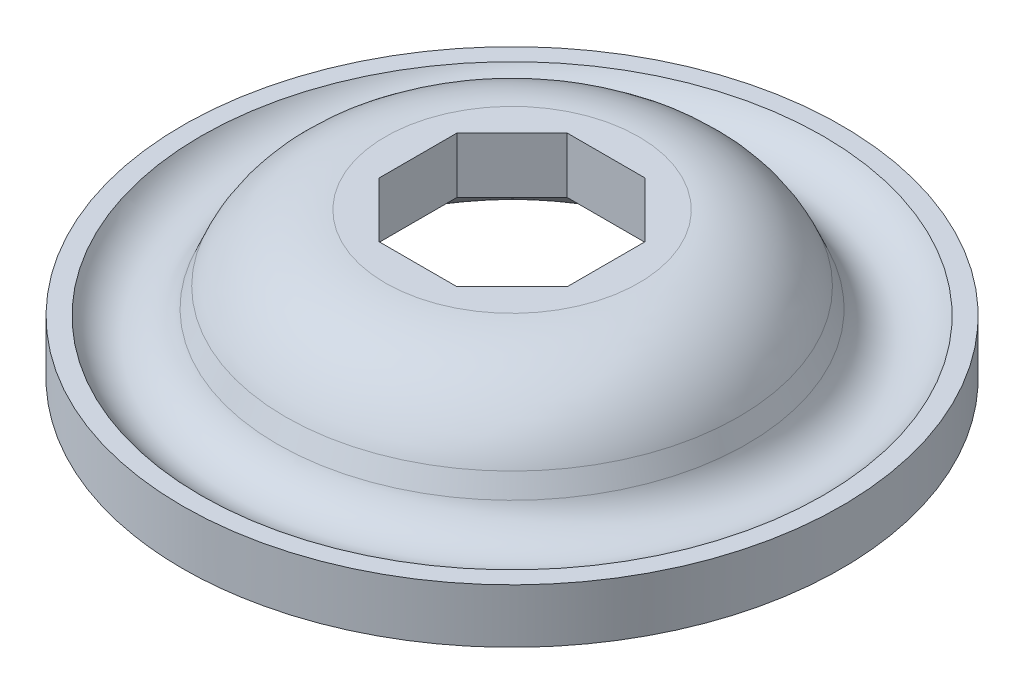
ISO-10303-21;
HEADER;
FILE_DESCRIPTION(('STEP AP214'),'2;1');
FILE_NAME('part.step','',(''),(''),'','','');
FILE_SCHEMA(('AUTOMOTIVE_DESIGN { 1 0 10303 214 1 1 1 1 }'));
ENDSEC;
DATA;
#1=APPLICATION_CONTEXT('core data for automotive mechanical design processes');
#2=APPLICATION_PROTOCOL_DEFINITION('international standard','automotive_design',2000,#1);
#3=PRODUCT_CONTEXT('',#1,'mechanical');
#4=PRODUCT('Part','Part','',(#3));
#5=PRODUCT_RELATED_PRODUCT_CATEGORY('part','',(#4));
#6=PRODUCT_DEFINITION_FORMATION('','',#4);
#7=PRODUCT_DEFINITION_CONTEXT('part definition',#1,'design');
#8=PRODUCT_DEFINITION('design','',#6,#7);
#9=PRODUCT_DEFINITION_SHAPE('','',#8);
#10=(LENGTH_UNIT() NAMED_UNIT(*) SI_UNIT(.MILLI.,.METRE.));
#11=(NAMED_UNIT(*) PLANE_ANGLE_UNIT() SI_UNIT($,.RADIAN.));
#12=(NAMED_UNIT(*) SI_UNIT($,.STERADIAN.) SOLID_ANGLE_UNIT());
#13=UNCERTAINTY_MEASURE_WITH_UNIT(LENGTH_MEASURE(1.E-05),#10,'distance_accuracy_value','');
#14=(GEOMETRIC_REPRESENTATION_CONTEXT(3) GLOBAL_UNCERTAINTY_ASSIGNED_CONTEXT((#13)) GLOBAL_UNIT_ASSIGNED_CONTEXT((#10,
#11,#12)) REPRESENTATION_CONTEXT('',''));
#15=CARTESIAN_POINT('',(0.,0.,0.));
#16=DIRECTION('',(0.,0.,1.));
#17=DIRECTION('',(1.,0.,0.));
#18=AXIS2_PLACEMENT_3D('',#15,#16,#17);
#19=CARTESIAN_POINT('',(-3.175,0.,0.));
#20=DIRECTION('',(0.,1.,0.));
#21=DIRECTION('',(0.,0.,1.));
#22=AXIS2_PLACEMENT_3D('',#19,#20,#21);
#23=PLANE('',#22);
#24=DIRECTION('',(0.,0.,1.));
#25=VECTOR('',#24,1.);
#26=CARTESIAN_POINT('',(-8.0137,0.,-3.31938322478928));
#27=LINE('',#26,#25);
#28=CARTESIAN_POINT('',(-8.0137,0.,3.31938322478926));
#29=VERTEX_POINT('',#28);
#30=CARTESIAN_POINT('',(-8.0137,0.,-3.31938322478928));
#31=VERTEX_POINT('',#30);
#32=EDGE_CURVE('E608',#29,#31,#27,.F.);
#33=ORIENTED_EDGE('',*,*,#32,.T.);
#34=DIRECTION('',(-0.707106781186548,0.,0.707106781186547));
#35=VECTOR('',#34,1.);
#36=CARTESIAN_POINT('',(-3.31938322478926,0.,-8.0137));
#37=LINE('',#36,#35);
#38=CARTESIAN_POINT('',(-3.31938322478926,0.,-8.0137));
#39=VERTEX_POINT('',#38);
#40=EDGE_CURVE('E602',#31,#39,#37,.F.);
#41=ORIENTED_EDGE('',*,*,#40,.T.);
#42=DIRECTION('',(-1.,0.,0.));
#43=VECTOR('',#42,1.);
#44=CARTESIAN_POINT('',(3.31938322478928,0.,-8.0137));
#45=LINE('',#44,#43);
#46=CARTESIAN_POINT('',(3.31938322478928,0.,-8.0137));
#47=VERTEX_POINT('',#46);
#48=EDGE_CURVE('E572',#39,#47,#45,.F.);
#49=ORIENTED_EDGE('',*,*,#48,.T.);
#50=DIRECTION('',(-0.707106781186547,0.,-0.707106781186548));
#51=VECTOR('',#50,1.);
#52=CARTESIAN_POINT('',(8.0137,0.,-3.31938322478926));
#53=LINE('',#52,#51);
#54=CARTESIAN_POINT('',(8.0137,0.,-3.31938322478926));
#55=VERTEX_POINT('',#54);
#56=EDGE_CURVE('E632',#47,#55,#53,.F.);
#57=ORIENTED_EDGE('',*,*,#56,.T.);
#58=DIRECTION('',(0.,0.,-1.));
#59=VECTOR('',#58,1.);
#60=CARTESIAN_POINT('',(8.0137,0.,3.31938322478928));
#61=LINE('',#60,#59);
#62=CARTESIAN_POINT('',(8.0137,0.,3.31938322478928));
#63=VERTEX_POINT('',#62);
#64=EDGE_CURVE('E626',#55,#63,#61,.F.);
#65=ORIENTED_EDGE('',*,*,#64,.T.);
#66=DIRECTION('',(0.707106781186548,0.,-0.707106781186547));
#67=VECTOR('',#66,1.);
#68=CARTESIAN_POINT('',(3.31938322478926,0.,8.0137));
#69=LINE('',#68,#67);
#70=CARTESIAN_POINT('',(3.31938322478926,0.,8.0137));
#71=VERTEX_POINT('',#70);
#72=EDGE_CURVE('E622',#63,#71,#69,.F.);
#73=ORIENTED_EDGE('',*,*,#72,.T.);
#74=DIRECTION('',(1.,0.,0.));
#75=VECTOR('',#74,1.);
#76=CARTESIAN_POINT('',(-3.31938322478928,0.,8.0137));
#77=LINE('',#76,#75);
#78=CARTESIAN_POINT('',(-3.31938322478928,0.,8.0137));
#79=VERTEX_POINT('',#78);
#80=EDGE_CURVE('E618',#71,#79,#77,.F.);
#81=ORIENTED_EDGE('',*,*,#80,.T.);
#82=DIRECTION('',(0.707106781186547,0.,0.707106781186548));
#83=VECTOR('',#82,1.);
#84=CARTESIAN_POINT('',(-8.0137,0.,3.31938322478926));
#85=LINE('',#84,#83);
#86=EDGE_CURVE('E614',#79,#29,#85,.F.);
#87=ORIENTED_EDGE('',*,*,#86,.T.);
#88=EDGE_LOOP('',(#33,#41,#49,#57,#65,#73,#81,#87));
#89=FACE_BOUND('',#88,.T.);
#90=CARTESIAN_POINT('',(0.,0.,0.));
#91=DIRECTION('',(0.,-1.,0.));
#92=DIRECTION('',(0.,0.,1.));
#93=AXIS2_PLACEMENT_3D('',#90,#91,#92);
#94=CIRCLE('',#93,10.795);
#95=CARTESIAN_POINT('',(0.,0.,10.795));
#96=VERTEX_POINT('',#95);
#97=EDGE_CURVE('E578',#96,#96,#94,.T.);
#98=ORIENTED_EDGE('',*,*,#97,.F.);
#99=EDGE_LOOP('',(#98));
#100=FACE_BOUND('',#99,.T.);
#101=ADVANCED_FACE('F16',(#89,#100),#23,.T.);
#102=CARTESIAN_POINT('',(0.,-9.23302034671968,0.));
#103=DIRECTION('',(0.,1.,0.));
#104=DIRECTION('',(0.,0.,1.));
#105=AXIS2_PLACEMENT_3D('',#102,#103,#104);
#106=TOROIDAL_SURFACE('',#105,10.795,9.23302034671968);
#107=ORIENTED_EDGE('',*,*,#97,.T.);
#108=EDGE_LOOP('',(#107));
#109=FACE_BOUND('',#108,.T.);
#110=CARTESIAN_POINT('',(0.,-5.62539188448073,0.));
#111=DIRECTION('',(0.,-1.,0.));
#112=DIRECTION('',(0.,0.,-1.));
#113=AXIS2_PLACEMENT_3D('',#110,#111,#112);
#114=CIRCLE('',#113,19.2940400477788);
#115=CARTESIAN_POINT('',(0.,-5.62539188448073,-19.2940400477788));
#116=VERTEX_POINT('',#115);
#117=EDGE_CURVE('E635',#116,#116,#114,.T.);
#118=ORIENTED_EDGE('',*,*,#117,.F.);
#119=EDGE_LOOP('',(#118));
#120=FACE_BOUND('',#119,.T.);
#121=ADVANCED_FACE('F562',(#109,#120),#106,.T.);
#122=CARTESIAN_POINT('',(3.31938322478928,-13.6906,-8.0137));
#123=DIRECTION('',(0.,0.,-1.));
#124=DIRECTION('',(-1.,0.,0.));
#125=AXIS2_PLACEMENT_3D('',#122,#123,#124);
#126=PLANE('',#125);
#127=DIRECTION('',(0.,1.,0.));
#128=VECTOR('',#127,1.);
#129=CARTESIAN_POINT('',(3.31938322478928,-13.6906,-8.01369999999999));
#130=LINE('',#129,#128);
#131=CARTESIAN_POINT('',(3.31938322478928,-4.7498,-8.0137));
#132=VERTEX_POINT('',#131);
#133=EDGE_CURVE('E630',#132,#47,#130,.T.);
#134=ORIENTED_EDGE('',*,*,#133,.T.);
#135=ORIENTED_EDGE('',*,*,#48,.F.);
#136=DIRECTION('',(0.,1.,0.));
#137=VECTOR('',#136,1.);
#138=CARTESIAN_POINT('',(-3.31938322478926,-13.6906,-8.0137));
#139=LINE('',#138,#137);
#140=CARTESIAN_POINT('',(-3.31938322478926,-4.7498,-8.0137));
#141=VERTEX_POINT('',#140);
#142=EDGE_CURVE('E606',#39,#141,#139,.F.);
#143=ORIENTED_EDGE('',*,*,#142,.T.);
#144=DIRECTION('',(1.,0.,0.));
#145=VECTOR('',#144,1.);
#146=CARTESIAN_POINT('',(-12.827,-4.7498,-8.0137));
#147=LINE('',#146,#145);
#148=EDGE_CURVE('E639',#132,#141,#147,.F.);
#149=ORIENTED_EDGE('',*,*,#148,.F.);
#150=EDGE_LOOP('',(#134,#135,#143,#149));
#151=FACE_BOUND('',#150,.T.);
#152=ADVANCED_FACE('F559',(#151),#126,.F.);
#153=CARTESIAN_POINT('',(-3.31938322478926,-13.6906,-8.0137));
#154=DIRECTION('',(-0.707106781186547,0.,-0.707106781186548));
#155=DIRECTION('',(-0.707106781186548,0.,0.707106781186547));
#156=AXIS2_PLACEMENT_3D('',#153,#154,#155);
#157=PLANE('',#156);
#158=ORIENTED_EDGE('',*,*,#142,.F.);
#159=ORIENTED_EDGE('',*,*,#40,.F.);
#160=DIRECTION('',(0.,1.,0.));
#161=VECTOR('',#160,1.);
#162=CARTESIAN_POINT('',(-8.0137,-13.6906,-3.31938322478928));
#163=LINE('',#162,#161);
#164=CARTESIAN_POINT('',(-8.0137,-4.7498,-3.31938322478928));
#165=VERTEX_POINT('',#164);
#166=EDGE_CURVE('E612',#31,#165,#163,.F.);
#167=ORIENTED_EDGE('',*,*,#166,.T.);
#168=DIRECTION('',(-0.707106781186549,0.,0.707106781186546));
#169=VECTOR('',#168,1.);
#170=CARTESIAN_POINT('',(-3.31938322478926,-4.7498,-8.0137));
#171=LINE('',#170,#169);
#172=EDGE_CURVE('E651',#141,#165,#171,.T.);
#173=ORIENTED_EDGE('',*,*,#172,.F.);
#174=EDGE_LOOP('',(#158,#159,#167,#173));
#175=FACE_BOUND('',#174,.T.);
#176=ADVANCED_FACE('F555',(#175),#157,.F.);
#177=CARTESIAN_POINT('',(-8.0137,-13.6906,-3.31938322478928));
#178=DIRECTION('',(-1.,0.,0.));
#179=DIRECTION('',(0.,0.,1.));
#180=AXIS2_PLACEMENT_3D('',#177,#178,#179);
#181=PLANE('',#180);
#182=ORIENTED_EDGE('',*,*,#166,.F.);
#183=ORIENTED_EDGE('',*,*,#32,.F.);
#184=DIRECTION('',(0.,1.,0.));
#185=VECTOR('',#184,1.);
#186=CARTESIAN_POINT('',(-8.0137,-13.6906,3.31938322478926));
#187=LINE('',#186,#185);
#188=CARTESIAN_POINT('',(-8.0137,-4.7498,3.31938322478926));
#189=VERTEX_POINT('',#188);
#190=EDGE_CURVE('E616',#29,#189,#187,.F.);
#191=ORIENTED_EDGE('',*,*,#190,.T.);
#192=DIRECTION('',(0.,0.,-1.));
#193=VECTOR('',#192,1.);
#194=CARTESIAN_POINT('',(-8.0137,-4.7498,0.));
#195=LINE('',#194,#193);
#196=EDGE_CURVE('E654',#165,#189,#195,.F.);
#197=ORIENTED_EDGE('',*,*,#196,.F.);
#198=EDGE_LOOP('',(#182,#183,#191,#197));
#199=FACE_BOUND('',#198,.T.);
#200=ADVANCED_FACE('F551',(#199),#181,.F.);
#201=CARTESIAN_POINT('',(-8.0137,-13.6906,3.31938322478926));
#202=DIRECTION('',(-0.707106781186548,0.,0.707106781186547));
#203=DIRECTION('',(0.707106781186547,0.,0.707106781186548));
#204=AXIS2_PLACEMENT_3D('',#201,#202,#203);
#205=PLANE('',#204);
#206=ORIENTED_EDGE('',*,*,#190,.F.);
#207=ORIENTED_EDGE('',*,*,#86,.F.);
#208=DIRECTION('',(0.,1.,0.));
#209=VECTOR('',#208,1.);
#210=CARTESIAN_POINT('',(-3.31938322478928,-13.6906,8.0137));
#211=LINE('',#210,#209);
#212=CARTESIAN_POINT('',(-3.31938322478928,-4.7498,8.01369999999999));
#213=VERTEX_POINT('',#212);
#214=EDGE_CURVE('E620',#79,#213,#211,.F.);
#215=ORIENTED_EDGE('',*,*,#214,.T.);
#216=DIRECTION('',(0.707106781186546,0.,0.707106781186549));
#217=VECTOR('',#216,1.);
#218=CARTESIAN_POINT('',(-8.0137,-4.7498,3.31938322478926));
#219=LINE('',#218,#217);
#220=EDGE_CURVE('E657',#189,#213,#219,.T.);
#221=ORIENTED_EDGE('',*,*,#220,.F.);
#222=EDGE_LOOP('',(#206,#207,#215,#221));
#223=FACE_BOUND('',#222,.T.);
#224=ADVANCED_FACE('F547',(#223),#205,.F.);
#225=CARTESIAN_POINT('',(-3.31938322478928,-13.6906,8.0137));
#226=DIRECTION('',(0.,0.,1.));
#227=DIRECTION('',(1.,0.,0.));
#228=AXIS2_PLACEMENT_3D('',#225,#226,#227);
#229=PLANE('',#228);
#230=ORIENTED_EDGE('',*,*,#214,.F.);
#231=ORIENTED_EDGE('',*,*,#80,.F.);
#232=DIRECTION('',(0.,1.,0.));
#233=VECTOR('',#232,1.);
#234=CARTESIAN_POINT('',(3.31938322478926,-13.6906,8.0137));
#235=LINE('',#234,#233);
#236=CARTESIAN_POINT('',(3.31938322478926,-4.7498,8.0137));
#237=VERTEX_POINT('',#236);
#238=EDGE_CURVE('E624',#71,#237,#235,.F.);
#239=ORIENTED_EDGE('',*,*,#238,.T.);
#240=DIRECTION('',(1.,0.,0.));
#241=VECTOR('',#240,1.);
#242=CARTESIAN_POINT('',(-12.827,-4.7498,8.0137));
#243=LINE('',#242,#241);
#244=EDGE_CURVE('E660',#213,#237,#243,.T.);
#245=ORIENTED_EDGE('',*,*,#244,.F.);
#246=EDGE_LOOP('',(#230,#231,#239,#245));
#247=FACE_BOUND('',#246,.T.);
#248=ADVANCED_FACE('F543',(#247),#229,.F.);
#249=CARTESIAN_POINT('',(3.31938322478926,-13.6906,8.0137));
#250=DIRECTION('',(0.707106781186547,0.,0.707106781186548));
#251=DIRECTION('',(0.707106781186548,0.,-0.707106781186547));
#252=AXIS2_PLACEMENT_3D('',#249,#250,#251);
#253=PLANE('',#252);
#254=ORIENTED_EDGE('',*,*,#238,.F.);
#255=ORIENTED_EDGE('',*,*,#72,.F.);
#256=DIRECTION('',(0.,1.,0.));
#257=VECTOR('',#256,1.);
#258=CARTESIAN_POINT('',(8.0137,-13.6906,3.31938322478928));
#259=LINE('',#258,#257);
#260=CARTESIAN_POINT('',(8.0137,-4.7498,3.31938322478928));
#261=VERTEX_POINT('',#260);
#262=EDGE_CURVE('E628',#63,#261,#259,.F.);
#263=ORIENTED_EDGE('',*,*,#262,.T.);
#264=DIRECTION('',(0.70710678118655,0.,-0.707106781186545));
#265=VECTOR('',#264,1.);
#266=CARTESIAN_POINT('',(3.31938322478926,-4.7498,8.0137));
#267=LINE('',#266,#265);
#268=EDGE_CURVE('E663',#237,#261,#267,.T.);
#269=ORIENTED_EDGE('',*,*,#268,.F.);
#270=EDGE_LOOP('',(#254,#255,#263,#269));
#271=FACE_BOUND('',#270,.T.);
#272=ADVANCED_FACE('F540',(#271),#253,.F.);
#273=CARTESIAN_POINT('',(8.0137,-13.6906,3.31938322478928));
#274=DIRECTION('',(1.,0.,0.));
#275=DIRECTION('',(0.,0.,-1.));
#276=AXIS2_PLACEMENT_3D('',#273,#274,#275);
#277=PLANE('',#276);
#278=ORIENTED_EDGE('',*,*,#262,.F.);
#279=ORIENTED_EDGE('',*,*,#64,.F.);
#280=DIRECTION('',(0.,1.,0.));
#281=VECTOR('',#280,1.);
#282=CARTESIAN_POINT('',(8.0137,-13.6906,-3.31938322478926));
#283=LINE('',#282,#281);
#284=CARTESIAN_POINT('',(8.0137,-4.7498,-3.31938322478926));
#285=VERTEX_POINT('',#284);
#286=EDGE_CURVE('E155',#55,#285,#283,.F.);
#287=ORIENTED_EDGE('',*,*,#286,.T.);
#288=DIRECTION('',(0.,0.,-1.));
#289=VECTOR('',#288,1.);
#290=CARTESIAN_POINT('',(8.0137,-4.7498,0.));
#291=LINE('',#290,#289);
#292=EDGE_CURVE('E665',#261,#285,#291,.T.);
#293=ORIENTED_EDGE('',*,*,#292,.F.);
#294=EDGE_LOOP('',(#278,#279,#287,#293));
#295=FACE_BOUND('',#294,.T.);
#296=ADVANCED_FACE('F536',(#295),#277,.F.);
#297=CARTESIAN_POINT('',(8.0137,-13.6906,-3.31938322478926));
#298=DIRECTION('',(0.707106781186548,0.,-0.707106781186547));
#299=DIRECTION('',(-0.707106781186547,0.,-0.707106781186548));
#300=AXIS2_PLACEMENT_3D('',#297,#298,#299);
#301=PLANE('',#300);
#302=ORIENTED_EDGE('',*,*,#286,.F.);
#303=ORIENTED_EDGE('',*,*,#56,.F.);
#304=ORIENTED_EDGE('',*,*,#133,.F.);
#305=DIRECTION('',(-0.707106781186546,0.,-0.707106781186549));
#306=VECTOR('',#305,1.);
#307=CARTESIAN_POINT('',(8.0137,-4.7498,-3.31938322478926));
#308=LINE('',#307,#306);
#309=EDGE_CURVE('E508',#285,#132,#308,.T.);
#310=ORIENTED_EDGE('',*,*,#309,.F.);
#311=EDGE_LOOP('',(#302,#303,#304,#310));
#312=FACE_BOUND('',#311,.T.);
#313=ADVANCED_FACE('F532',(#312),#301,.F.);
#314=CARTESIAN_POINT('',(0.,-7.28106274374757,0.));
#315=DIRECTION('',(0.,-1.,0.));
#316=DIRECTION('',(0.,0.,-1.));
#317=AXIS2_PLACEMENT_3D('',#314,#315,#316);
#318=CONICAL_SURFACE('',#317,19.9968306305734,0.401425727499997);
#319=CARTESIAN_POINT('',(0.,-7.28106274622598,0.));
#320=DIRECTION('',(0.,1.,0.));
#321=DIRECTION('',(0.,0.,1.));
#322=AXIS2_PLACEMENT_3D('',#319,#320,#321);
#323=CIRCLE('',#322,19.9968306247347);
#324=CARTESIAN_POINT('',(0.,-7.28106274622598,19.9968306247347));
#325=VERTEX_POINT('',#324);
#326=EDGE_CURVE('E504',#325,#325,#323,.T.);
#327=ORIENTED_EDGE('',*,*,#326,.T.);
#328=EDGE_LOOP('',(#327));
#329=FACE_BOUND('',#328,.T.);
#330=ORIENTED_EDGE('',*,*,#117,.T.);
#331=EDGE_LOOP('',(#330));
#332=FACE_BOUND('',#331,.T.);
#333=ADVANCED_FACE('F528',(#329,#332),#318,.T.);
#334=CARTESIAN_POINT('',(-12.827,-4.7498,0.));
#335=DIRECTION('',(0.,-1.,0.));
#336=DIRECTION('',(0.,0.,-1.));
#337=AXIS2_PLACEMENT_3D('',#334,#335,#336);
#338=PLANE('',#337);
#339=ORIENTED_EDGE('',*,*,#292,.T.);
#340=ORIENTED_EDGE('',*,*,#309,.T.);
#341=ORIENTED_EDGE('',*,*,#148,.T.);
#342=ORIENTED_EDGE('',*,*,#172,.T.);
#343=ORIENTED_EDGE('',*,*,#196,.T.);
#344=ORIENTED_EDGE('',*,*,#220,.T.);
#345=ORIENTED_EDGE('',*,*,#244,.T.);
#346=ORIENTED_EDGE('',*,*,#268,.T.);
#347=EDGE_LOOP('',(#339,#340,#341,#342,#343,#344,#345,#346));
#348=FACE_BOUND('',#347,.T.);
#349=CARTESIAN_POINT('',(0.,-4.7498,0.));
#350=DIRECTION('',(0.,1.,0.));
#351=DIRECTION('',(0.,0.,1.));
#352=AXIS2_PLACEMENT_3D('',#349,#350,#351);
#353=CIRCLE('',#352,12.827);
#354=CARTESIAN_POINT('',(0.,-4.7498,12.827));
#355=VERTEX_POINT('',#354);
#356=EDGE_CURVE('E507',#355,#355,#353,.F.);
#357=ORIENTED_EDGE('',*,*,#356,.T.);
#358=EDGE_LOOP('',(#357));
#359=FACE_BOUND('',#358,.T.);
#360=ADVANCED_FACE('F519',(#348,#359),#338,.T.);
#361=CARTESIAN_POINT('',(0.,-5.842,0.));
#362=DIRECTION('',(0.,1.,0.));
#363=DIRECTION('',(0.,0.,1.));
#364=AXIS2_PLACEMENT_3D('',#361,#362,#363);
#365=TOROIDAL_SURFACE('',#364,23.38705,3.683);
#366=CARTESIAN_POINT('',(0.,-7.8105,0.));
#367=DIRECTION('',(0.,1.,0.));
#368=DIRECTION('',(0.,0.,1.));
#369=AXIS2_PLACEMENT_3D('',#366,#367,#368);
#370=CIRCLE('',#369,26.4998456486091);
#371=CARTESIAN_POINT('',(0.,-7.8105,26.4998456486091));
#372=VERTEX_POINT('',#371);
#373=EDGE_CURVE('E20',#372,#372,#370,.F.);
#374=ORIENTED_EDGE('',*,*,#373,.F.);
#375=EDGE_LOOP('',(#374));
#376=FACE_BOUND('',#375,.T.);
#377=ORIENTED_EDGE('',*,*,#326,.F.);
#378=EDGE_LOOP('',(#377));
#379=FACE_BOUND('',#378,.T.);
#380=ADVANCED_FACE('F493',(#376,#379),#365,.F.);
#381=CARTESIAN_POINT('',(0.,-5.7023,0.));
#382=DIRECTION('',(0.,1.,0.));
#383=DIRECTION('',(0.,0.,1.));
#384=AXIS2_PLACEMENT_3D('',#381,#382,#383);
#385=TOROIDAL_SURFACE('',#384,12.827,0.9525);
#386=ORIENTED_EDGE('',*,*,#356,.F.);
#387=EDGE_LOOP('',(#386));
#388=FACE_BOUND('',#387,.T.);
#389=CARTESIAN_POINT('',(0.,-5.33012859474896,0.));
#390=DIRECTION('',(0.,-1.,0.));
#391=DIRECTION('',(0.,0.,-1.));
#392=AXIS2_PLACEMENT_3D('',#389,#390,#391);
#393=CIRCLE('',#392,13.7037808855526);
#394=CARTESIAN_POINT('',(0.,-5.33012859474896,-13.7037808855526));
#395=VERTEX_POINT('',#394);
#396=EDGE_CURVE('E1062',#395,#395,#393,.T.);
#397=ORIENTED_EDGE('',*,*,#396,.T.);
#398=EDGE_LOOP('',(#397));
#399=FACE_BOUND('',#398,.T.);
#400=ADVANCED_FACE('F487',(#388,#399),#385,.F.);
#401=CARTESIAN_POINT('',(-26.4998456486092,-7.8105,0.));
#402=DIRECTION('',(0.,1.,0.));
#403=DIRECTION('',(0.,0.,1.));
#404=AXIS2_PLACEMENT_3D('',#401,#402,#403);
#405=PLANE('',#404);
#406=ORIENTED_EDGE('',*,*,#373,.T.);
#407=EDGE_LOOP('',(#406));
#408=FACE_BOUND('',#407,.T.);
#409=CARTESIAN_POINT('',(0.,-7.8105,0.));
#410=DIRECTION('',(0.,1.,0.));
#411=DIRECTION('',(0.,0.,1.));
#412=AXIS2_PLACEMENT_3D('',#409,#410,#411);
#413=CIRCLE('',#412,28.067);
#414=CARTESIAN_POINT('',(0.,-7.8105,28.067));
#415=VERTEX_POINT('',#414);
#416=EDGE_CURVE('E237',#415,#415,#413,.F.);
#417=ORIENTED_EDGE('',*,*,#416,.F.);
#418=EDGE_LOOP('',(#417));
#419=FACE_BOUND('',#418,.T.);
#420=ADVANCED_FACE('F483',(#408,#419),#405,.T.);
#421=CARTESIAN_POINT('',(0.,-8.04380019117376,0.));
#422=DIRECTION('',(0.,-1.,0.));
#423=DIRECTION('',(0.,0.,-1.));
#424=AXIS2_PLACEMENT_3D('',#421,#422,#423);
#425=CONICAL_SURFACE('',#424,14.8556661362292,0.401425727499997);
#426=CARTESIAN_POINT('',(0.,-8.0438001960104,0.));
#427=DIRECTION('',(0.,1.,0.));
#428=DIRECTION('',(0.,0.,1.));
#429=AXIS2_PLACEMENT_3D('',#426,#427,#428);
#430=CIRCLE('',#429,14.8556661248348);
#431=CARTESIAN_POINT('',(0.,-8.0438001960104,14.8556661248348));
#432=VERTEX_POINT('',#431);
#433=EDGE_CURVE('E247',#432,#432,#430,.T.);
#434=ORIENTED_EDGE('',*,*,#433,.F.);
#435=EDGE_LOOP('',(#434));
#436=FACE_BOUND('',#435,.T.);
#437=ORIENTED_EDGE('',*,*,#396,.F.);
#438=EDGE_LOOP('',(#437));
#439=FACE_BOUND('',#438,.T.);
#440=ADVANCED_FACE('F480',(#436,#439),#425,.F.);
#441=CARTESIAN_POINT('',(-31.2549909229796,-12.4206,-24.8790090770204));
#442=DIRECTION('',(0.,1.,0.));
#443=DIRECTION('',(0.,0.,1.));
#444=AXIS2_PLACEMENT_3D('',#441,#442,#443);
#445=PLANE('',#444);
#446=DIRECTION('',(0.,0.,1.));
#447=VECTOR('',#446,1.);
#448=CARTESIAN_POINT('',(-4.5084999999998,-12.4206,28.0670000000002));
#449=LINE('',#448,#447);
#450=CARTESIAN_POINT('',(-4.5084999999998,-12.4206,27.7025254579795));
#451=VERTEX_POINT('',#450);
#452=CARTESIAN_POINT('',(-4.50849999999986,-12.4206,18.1527953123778));
#453=VERTEX_POINT('',#452);
#454=EDGE_CURVE('E1061',#451,#453,#449,.F.);
#455=ORIENTED_EDGE('',*,*,#454,.T.);
#456=CARTESIAN_POINT('',(0.,-12.4206,0.));
#457=DIRECTION('',(0.,1.,0.));
#458=DIRECTION('',(0.,0.,1.));
#459=AXIS2_PLACEMENT_3D('',#456,#457,#458);
#460=CIRCLE('',#459,18.7042922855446);
#461=CARTESIAN_POINT('',(4.50850000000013,-12.4206,18.1527953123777));
#462=VERTEX_POINT('',#461);
#463=EDGE_CURVE('E232',#462,#453,#460,.F.);
#464=ORIENTED_EDGE('',*,*,#463,.F.);
#465=DIRECTION('',(0.,0.,1.));
#466=VECTOR('',#465,1.);
#467=CARTESIAN_POINT('',(4.5085000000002,-12.4206,28.0670000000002));
#468=LINE('',#467,#466);
#469=CARTESIAN_POINT('',(4.50850000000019,-12.4206,27.7025254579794));
#470=VERTEX_POINT('',#469);
#471=EDGE_CURVE('E234',#462,#470,#468,.T.);
#472=ORIENTED_EDGE('',*,*,#471,.T.);
#473=CARTESIAN_POINT('',(0.,-12.4206,0.));
#474=DIRECTION('',(0.,1.,0.));
#475=DIRECTION('',(0.,0.,1.));
#476=AXIS2_PLACEMENT_3D('',#473,#474,#475);
#477=CIRCLE('',#476,28.067);
#478=EDGE_CURVE('E146',#451,#470,#477,.T.);
#479=ORIENTED_EDGE('',*,*,#478,.F.);
#480=EDGE_LOOP('',(#455,#464,#472,#479));
#481=FACE_BOUND('',#480,.T.);
#482=ADVANCED_FACE('F235',(#481),#445,.F.);
#483=CARTESIAN_POINT('',(-4.5084999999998,-12.4206,28.0670000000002));
#484=DIRECTION('',(-0.984807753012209,0.173648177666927,0.));
#485=DIRECTION('',(-0.173648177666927,-0.984807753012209,0.));
#486=AXIS2_PLACEMENT_3D('',#483,#484,#485);
#487=PLANE('',#486);
#488=CARTESIAN_POINT('',(-4.50849999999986,-12.4206,18.1527953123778));
#489=CARTESIAN_POINT('',(-4.53169675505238,-12.5521553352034,18.3785031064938));
#490=CARTESIAN_POINT('',(-4.55318758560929,-12.6740358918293,18.6099977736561));
#491=CARTESIAN_POINT('',(-4.59264669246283,-12.8978196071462,19.0826825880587));
#492=CARTESIAN_POINT('',(-4.61061569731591,-12.9997268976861,19.3238707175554));
#493=CARTESIAN_POINT('',(-4.64289715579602,-13.1828041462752,19.8136586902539));
#494=CARTESIAN_POINT('',(-4.65721699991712,-13.2640160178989,20.0622423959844));
#495=CARTESIAN_POINT('',(-4.68217662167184,-13.405569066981,20.5654668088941));
#496=CARTESIAN_POINT('',(-4.69281629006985,-13.4659096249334,20.820107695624));
#497=CARTESIAN_POINT('',(-4.71036247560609,-13.5654189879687,21.3334991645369));
#498=CARTESIAN_POINT('',(-4.71727063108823,-13.6045970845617,21.5922478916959));
#499=CARTESIAN_POINT('',(-4.72733701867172,-13.6616864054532,22.1121594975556));
#500=CARTESIAN_POINT('',(-4.73049510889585,-13.679596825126,22.3733224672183));
#501=CARTESIAN_POINT('',(-4.73306053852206,-13.6941460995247,22.8964503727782));
#502=CARTESIAN_POINT('',(-4.73246508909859,-13.6907691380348,23.1584157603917));
#503=CARTESIAN_POINT('',(-4.72753807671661,-13.662826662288,23.6811687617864));
#504=CARTESIAN_POINT('',(-4.72320660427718,-13.6382616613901,23.9419564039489));
#505=CARTESIAN_POINT('',(-4.71072488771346,-13.5674743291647,24.4658825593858));
#506=CARTESIAN_POINT('',(-4.70249887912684,-13.5208223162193,24.7289612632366));
#507=CARTESIAN_POINT('',(-4.68227034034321,-13.4061005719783,25.2502541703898));
#508=CARTESIAN_POINT('',(-4.67026787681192,-13.3380312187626,25.5084684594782));
#509=CARTESIAN_POINT('',(-4.64260251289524,-13.1811331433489,26.0178123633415));
#510=CARTESIAN_POINT('',(-4.62694589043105,-13.0923400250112,26.2689533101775));
#511=CARTESIAN_POINT('',(-4.59207960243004,-12.8946034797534,26.7627939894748));
#512=CARTESIAN_POINT('',(-4.5728720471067,-12.7856720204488,27.0054986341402));
#513=CARTESIAN_POINT('',(-4.54512341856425,-12.6283017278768,27.3208445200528));
#514=CARTESIAN_POINT('',(-4.53810346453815,-12.588489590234,27.3980104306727));
#515=CARTESIAN_POINT('',(-4.52371121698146,-12.5068670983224,27.5511360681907));
#516=CARTESIAN_POINT('',(-4.51633931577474,-12.4650589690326,27.6270970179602));
#517=CARTESIAN_POINT('',(-4.50878974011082,-12.422243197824,27.7024783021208));
#518=B_SPLINE_CURVE_WITH_KNOTS('',3,(#488,#489,#490,#491,#492,#493,#494,#495,#496,#497,#498,
#499,#500,#501,#502,#503,#504,#505,#506,#507,#508,#509,#510,#511,#512,#513,#514,#515,#516,#517),
.UNSPECIFIED.,.F.,.F.,(4,2,2,2,2,2,2,2,2,2,2,2,2,2,4),(0.,0.786550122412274,1.57293735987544,
2.35771907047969,3.14252407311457,3.9269842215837,4.71147404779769,5.49654680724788,
6.28160054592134,7.0825969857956,7.88357928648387,8.68319548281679,9.4823380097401,
9.74365746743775,10.004692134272),.UNSPECIFIED.);
#519=CARTESIAN_POINT('',(-4.50878974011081,-12.422243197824,27.7024783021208));
#520=VERTEX_POINT('',#519);
#521=EDGE_CURVE('E454',#453,#520,#518,.T.);
#522=ORIENTED_EDGE('',*,*,#521,.F.);
#523=ORIENTED_EDGE('',*,*,#454,.F.);
#524=CARTESIAN_POINT('',(-4.50878974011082,-12.422243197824,27.7024783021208));
#525=CARTESIAN_POINT('',(-4.50877187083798,-12.4221418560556,27.7024812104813));
#526=CARTESIAN_POINT('',(-4.50875400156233,-12.4220405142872,27.7024841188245));
#527=CARTESIAN_POINT('',(-4.50871991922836,-12.4218472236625,27.7024896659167));
#528=CARTESIAN_POINT('',(-4.50870370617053,-12.4217552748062,27.7024923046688));
#529=CARTESIAN_POINT('',(-4.50867293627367,-12.4215807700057,27.7024973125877));
#530=CARTESIAN_POINT('',(-4.50865837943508,-12.4214982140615,27.7024996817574));
#531=CARTESIAN_POINT('',(-4.50863092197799,-12.4213424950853,27.7025041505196));
#532=CARTESIAN_POINT('',(-4.50861802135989,-12.4212693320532,27.7025062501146));
#533=CARTESIAN_POINT('',(-4.508593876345,-12.4211323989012,27.7025101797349));
#534=CARTESIAN_POINT('',(-4.50858263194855,-12.4210686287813,27.7025120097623));
#535=CARTESIAN_POINT('',(-4.50856179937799,-12.4209504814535,27.7025154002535));
#536=CARTESIAN_POINT('',(-4.50855221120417,-12.4208961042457,27.7025169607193));
#537=CARTESIAN_POINT('',(-4.5085346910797,-12.4207967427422,27.7025198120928));
#538=CARTESIAN_POINT('',(-4.50852675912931,-12.4207517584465,27.7025211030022));
#539=CARTESIAN_POINT('',(-4.50851255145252,-12.4206711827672,27.7025234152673));
#540=CARTESIAN_POINT('',(-4.50850627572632,-12.4206355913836,27.7025244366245));
#541=CARTESIAN_POINT('',(-4.5084999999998,-12.4206,27.7025254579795));
#542=B_SPLINE_CURVE_WITH_KNOTS('',3,(#524,#525,#526,#527,#528,#529,#530,#531,#532,#533,#534,
#535,#536,#537,#538,#539,#540,#541),.UNSPECIFIED.,.F.,.F.,(4,2,2,2,2,2,2,2,4),(0.,
0.000308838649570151,0.000589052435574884,0.000840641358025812,0.00106360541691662,
0.00125794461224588,0.00142365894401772,0.00156074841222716,0.00166921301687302),.UNSPECIFIED.);
#543=EDGE_CURVE('E242',#520,#451,#542,.T.);
#544=ORIENTED_EDGE('',*,*,#543,.F.);
#545=EDGE_LOOP('',(#522,#523,#544));
#546=FACE_BOUND('',#545,.T.);
#547=ADVANCED_FACE('F470',(#546),#487,.F.);
#548=CARTESIAN_POINT('',(-24.7206629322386,-13.6906,31.4133370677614));
#549=DIRECTION('',(0.696364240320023,0.173648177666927,0.696364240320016));
#550=DIRECTION('',(0.707106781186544,0.,-0.707106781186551));
#551=AXIS2_PLACEMENT_3D('',#548,#549,#550);
#552=PLANE('',#551);
#553=DIRECTION('',(0.707106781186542,0.,-0.707106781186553));
#554=VECTOR('',#553,1.);
#555=CARTESIAN_POINT('',(-16.4006526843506,-12.4206,22.7766345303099));
#556=LINE('',#555,#554);
#557=CARTESIAN_POINT('',(-16.4006526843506,-12.4206,22.7766345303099));
#558=VERTEX_POINT('',#557);
#559=CARTESIAN_POINT('',(-9.64797373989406,-12.4206,16.0239555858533));
#560=VERTEX_POINT('',#559);
#561=EDGE_CURVE('E1001',#558,#560,#556,.T.);
#562=ORIENTED_EDGE('',*,*,#561,.T.);
#563=CARTESIAN_POINT('',(-16.4004144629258,-12.422243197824,22.7768060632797));
#564=CARTESIAN_POINT('',(-16.218266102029,-12.5552650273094,22.6278285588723));
#565=CARTESIAN_POINT('',(-16.0333027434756,-12.6785544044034,22.473609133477));
#566=CARTESIAN_POINT('',(-15.6590768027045,-12.9048892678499,22.1558229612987));
#567=CARTESIAN_POINT('',(-15.469814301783,-13.0079351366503,21.9922563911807));
#568=CARTESIAN_POINT('',(-15.0884543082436,-13.1929409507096,21.6570301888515));
#569=CARTESIAN_POINT('',(-14.8963590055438,-13.2749163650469,21.4853766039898));
#570=CARTESIAN_POINT('',(-14.5105567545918,-13.417270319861,21.1350723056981));
#571=CARTESIAN_POINT('',(-14.3168498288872,-13.477649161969,20.9564216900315));
#572=CARTESIAN_POINT('',(-13.9290515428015,-13.5763632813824,20.5932391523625));
#573=CARTESIAN_POINT('',(-13.7349600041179,-13.6146822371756,20.4087029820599));
#574=CARTESIAN_POINT('',(-13.3478388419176,-13.6688728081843,20.0350949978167));
#575=CARTESIAN_POINT('',(-13.1548097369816,-13.6847342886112,19.8460211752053));
#576=CARTESIAN_POINT('',(-12.7713712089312,-13.6937660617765,19.4648348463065));
#577=CARTESIAN_POINT('',(-12.5809608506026,-13.6869446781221,19.2727234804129));
#578=CARTESIAN_POINT('',(-12.2041789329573,-13.6505728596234,18.8868717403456));
#579=CARTESIAN_POINT('',(-12.0178056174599,-13.6210325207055,18.6931321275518));
#580=CARTESIAN_POINT('',(-11.6350030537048,-13.5358831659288,18.2890963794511));
#581=CARTESIAN_POINT('',(-11.4390388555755,-13.4782980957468,18.0787725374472));
#582=CARTESIAN_POINT('',(-11.0551557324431,-13.3368340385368,17.6596133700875));
#583=CARTESIAN_POINT('',(-10.8672371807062,-13.2529538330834,17.4507781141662));
#584=CARTESIAN_POINT('',(-10.5005044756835,-13.0590382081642,17.035689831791));
#585=CARTESIAN_POINT('',(-10.3217276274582,-12.948904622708,16.8294496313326));
#586=CARTESIAN_POINT('',(-9.97573523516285,-12.7034442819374,16.422248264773));
#587=CARTESIAN_POINT('',(-9.80852219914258,-12.5681120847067,16.2212882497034));
#588=CARTESIAN_POINT('',(-9.64797373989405,-12.4206,16.0239555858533));
#589=B_SPLINE_CURVE_WITH_KNOTS('',3,(#563,#564,#565,#566,#567,#568,#569,#570,#571,#572,#573,
#574,#575,#576,#577,#578,#579,#580,#581,#582,#583,#584,#585,#586,#587,#588),.UNSPECIFIED.,.F.,
.F.,(4,2,2,2,2,2,2,2,2,2,2,2,4),(0.,0.810685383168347,1.62135544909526,2.43142864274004,
3.24149052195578,4.05215097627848,4.86317715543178,5.67390575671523,6.48427429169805,
7.36251120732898,8.24078882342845,9.12240346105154,10.0042087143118),.UNSPECIFIED.);
#590=CARTESIAN_POINT('',(-16.4004144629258,-12.422243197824,22.7768060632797));
#591=VERTEX_POINT('',#590);
#592=EDGE_CURVE('E453',#591,#560,#589,.T.);
#593=ORIENTED_EDGE('',*,*,#592,.F.);
#594=CARTESIAN_POINT('',(-16.4006526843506,-12.4206,22.7766345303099));
#595=CARTESIAN_POINT('',(-16.4006427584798,-12.4206684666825,22.77664167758));
#596=CARTESIAN_POINT('',(-16.4006328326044,-12.4207369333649,22.7766488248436));
#597=CARTESIAN_POINT('',(-16.4006129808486,-12.4208738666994,22.7766631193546));
#598=CARTESIAN_POINT('',(-16.4006030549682,-12.4209423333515,22.7766702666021));
#599=CARTESIAN_POINT('',(-16.4005832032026,-12.4210792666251,22.7766845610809));
#600=CARTESIAN_POINT('',(-16.4005732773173,-12.4211477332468,22.7766917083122));
#601=CARTESIAN_POINT('',(-16.4005534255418,-12.4212846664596,22.7767060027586));
#602=CARTESIAN_POINT('',(-16.4005434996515,-12.4213531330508,22.7767131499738));
#603=CARTESIAN_POINT('',(-16.4005236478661,-12.4214900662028,22.7767274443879));
#604=CARTESIAN_POINT('',(-16.400513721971,-12.4215585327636,22.7767345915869));
#605=CARTESIAN_POINT('',(-16.4004938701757,-12.4216954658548,22.7767488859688));
#606=CARTESIAN_POINT('',(-16.4004839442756,-12.4217639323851,22.7767560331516));
#607=CARTESIAN_POINT('',(-16.4004640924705,-12.4219008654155,22.7767703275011));
#608=CARTESIAN_POINT('',(-16.4004541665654,-12.4219693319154,22.7767774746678));
#609=CARTESIAN_POINT('',(-16.4004343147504,-12.4221062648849,22.7767917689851));
#610=CARTESIAN_POINT('',(-16.4004243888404,-12.4221747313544,22.7767989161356));
#611=CARTESIAN_POINT('',(-16.4004144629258,-12.422243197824,22.7768060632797));
#612=B_SPLINE_CURVE_WITH_KNOTS('',3,(#594,#595,#596,#597,#598,#599,#600,#601,#602,#603,#604,
#605,#606,#607,#608,#609,#610,#611),.UNSPECIFIED.,.F.,.F.,(4,2,2,2,2,2,2,2,4),(0.,
0.00020865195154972,0.000417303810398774,0.000625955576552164,0.000834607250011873,
0.00104325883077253,0.00125191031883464,0.00146056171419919,0.00166921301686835),.UNSPECIFIED.);
#613=EDGE_CURVE('E328',#558,#591,#612,.T.);
#614=ORIENTED_EDGE('',*,*,#613,.F.);
#615=EDGE_LOOP('',(#562,#593,#614));
#616=FACE_BOUND('',#615,.T.);
#617=ADVANCED_FACE('F474',(#616),#552,.F.);
#618=CARTESIAN_POINT('',(-31.2549909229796,-12.4206,-24.8790090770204));
#619=DIRECTION('',(0.,1.,0.));
#620=DIRECTION('',(0.,0.,1.));
#621=AXIS2_PLACEMENT_3D('',#618,#619,#620);
#622=PLANE('',#621);
#623=DIRECTION('',(-0.707106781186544,0.,0.707106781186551));
#624=VECTOR('',#623,1.);
#625=CARTESIAN_POINT('',(-31.2549909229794,-12.4206,24.8790090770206));
#626=LINE('',#625,#624);
#627=CARTESIAN_POINT('',(-22.7766345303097,-12.4206,16.4006526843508));
#628=VERTEX_POINT('',#627);
#629=CARTESIAN_POINT('',(-16.0239555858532,-12.4206,9.6479737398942));
#630=VERTEX_POINT('',#629);
#631=EDGE_CURVE('E1002',#628,#630,#626,.F.);
#632=ORIENTED_EDGE('',*,*,#631,.T.);
#633=CARTESIAN_POINT('',(0.,-12.4206,0.));
#634=DIRECTION('',(0.,1.,0.));
#635=DIRECTION('',(0.,0.,1.));
#636=AXIS2_PLACEMENT_3D('',#633,#634,#635);
#637=CIRCLE('',#636,18.7042922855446);
#638=EDGE_CURVE('E458',#560,#630,#637,.F.);
#639=ORIENTED_EDGE('',*,*,#638,.F.);
#640=ORIENTED_EDGE('',*,*,#561,.F.);
#641=CARTESIAN_POINT('',(0.,-12.4206,0.));
#642=DIRECTION('',(0.,1.,0.));
#643=DIRECTION('',(0.,0.,1.));
#644=AXIS2_PLACEMENT_3D('',#641,#642,#643);
#645=CIRCLE('',#644,28.067);
#646=EDGE_CURVE('E327',#628,#558,#645,.T.);
#647=ORIENTED_EDGE('',*,*,#646,.F.);
#648=EDGE_LOOP('',(#632,#639,#640,#647));
#649=FACE_BOUND('',#648,.T.);
#650=ADVANCED_FACE('F768',(#649),#622,.F.);
#651=CARTESIAN_POINT('',(-31.2549909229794,-12.4206,24.8790090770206));
#652=DIRECTION('',(-0.696364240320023,0.173648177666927,-0.696364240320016));
#653=DIRECTION('',(-0.707106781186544,0.,0.707106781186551));
#654=AXIS2_PLACEMENT_3D('',#651,#652,#653);
#655=PLANE('',#654);
#656=CARTESIAN_POINT('',(-16.0239555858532,-12.4206,9.64797373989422));
#657=CARTESIAN_POINT('',(-16.1999576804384,-12.5521553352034,9.79117066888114));
#658=CARTESIAN_POINT('',(-16.3788454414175,-12.6740358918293,9.93966580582));
#659=CARTESIAN_POINT('',(-16.7409858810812,-12.8978196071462,10.2460026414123));
#660=CARTESIAN_POINT('',(-16.9242376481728,-12.9997268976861,10.4038423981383));
#661=CARTESIAN_POINT('',(-17.2933964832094,-13.1828041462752,10.7273483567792));
#662=CARTESIAN_POINT('',(-17.4792973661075,-13.2640160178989,10.8929979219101));
#663=CARTESIAN_POINT('',(-17.8527798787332,-13.405569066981,11.2311821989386));
#664=CARTESIAN_POINT('',(-18.040361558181,-13.4659096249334,11.4037171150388));
#665=CARTESIAN_POINT('',(-18.4157911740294,-13.5654189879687,11.7543326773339));
#666=CARTESIAN_POINT('',(-18.6036389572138,-13.6045970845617,11.9324108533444));
#667=CARTESIAN_POINT('',(-18.9783899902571,-13.6616864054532,12.2929258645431));
#668=CARTESIAN_POINT('',(-19.1652932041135,-13.679596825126,12.4753628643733));
#669=CARTESIAN_POINT('',(-19.5370145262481,-13.6941460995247,12.8434561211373));
#670=CARTESIAN_POINT('',(-19.7218309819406,-13.6907691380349,13.0291146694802));
#671=CARTESIAN_POINT('',(-20.0879892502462,-13.662826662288,13.4022407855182));
#672=CARTESIAN_POINT('',(-20.2693311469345,-13.6382616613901,13.5897083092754));
#673=CARTESIAN_POINT('',(-20.6309769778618,-13.5674743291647,13.9690059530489));
#674=CARTESIAN_POINT('',(-20.8111850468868,-13.5208223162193,14.1608473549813));
#675=CARTESIAN_POINT('',(-21.1654910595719,-13.4061005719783,14.5437608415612));
#676=CARTESIAN_POINT('',(-21.3395891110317,-13.3380312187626,14.7348329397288));
#677=CARTESIAN_POINT('',(-21.6801872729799,-13.1811331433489,15.114555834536));
#678=CARTESIAN_POINT('',(-21.8466998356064,-13.0923400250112,15.3032102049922));
#679=CARTESIAN_POINT('',(-22.171243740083,-12.8946034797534,15.6770624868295));
#680=CARTESIAN_POINT('',(-22.3292800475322,-12.7856720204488,15.862262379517));
#681=CARTESIAN_POINT('',(-22.5326420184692,-12.6283017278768,16.1048668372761));
#682=CARTESIAN_POINT('',(-22.5822427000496,-12.588489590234,16.1643952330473));
#683=CARTESIAN_POINT('',(-22.6803420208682,-12.5068670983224,16.2828482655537));
#684=CARTESIAN_POINT('',(-22.7288418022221,-12.4650589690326,16.3417734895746));
#685=CARTESIAN_POINT('',(-22.7768060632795,-12.422243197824,16.4004144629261));
#686=B_SPLINE_CURVE_WITH_KNOTS('',3,(#656,#657,#658,#659,#660,#661,#662,#663,#664,#665,#666,
#667,#668,#669,#670,#671,#672,#673,#674,#675,#676,#677,#678,#679,#680,#681,#682,#683,#684,#685),
.UNSPECIFIED.,.F.,.F.,(4,2,2,2,2,2,2,2,2,2,2,2,2,2,4),(0.,0.786550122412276,1.57293735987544,
2.35771907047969,3.14252407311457,3.92698422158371,4.71147404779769,5.49654680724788,
6.28160054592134,7.08259698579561,7.88357928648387,8.6831954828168,9.48233800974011,
9.74365746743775,10.004692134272),.UNSPECIFIED.);
#687=CARTESIAN_POINT('',(-22.7768060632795,-12.422243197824,16.4004144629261));
#688=VERTEX_POINT('',#687);
#689=EDGE_CURVE('E450',#630,#688,#686,.T.);
#690=ORIENTED_EDGE('',*,*,#689,.F.);
#691=ORIENTED_EDGE('',*,*,#631,.F.);
#692=CARTESIAN_POINT('',(-22.7768060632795,-12.422243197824,16.4004144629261));
#693=CARTESIAN_POINT('',(-22.7767952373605,-12.4221394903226,16.4004294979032));
#694=CARTESIAN_POINT('',(-22.7767844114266,-12.4220357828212,16.4004445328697));
#695=CARTESIAN_POINT('',(-22.7767638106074,-12.4218384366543,16.4004731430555));
#696=CARTESIAN_POINT('',(-22.7767540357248,-12.4217447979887,16.4004867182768));
#697=CARTESIAN_POINT('',(-22.7767355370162,-12.4215675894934,16.4005124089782));
#698=CARTESIAN_POINT('',(-22.7767268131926,-12.4214840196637,16.4005245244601));
#699=CARTESIAN_POINT('',(-22.7767104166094,-12.42132694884,16.4005472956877));
#700=CARTESIAN_POINT('',(-22.7767027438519,-12.4212534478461,16.4005579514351));
#701=CARTESIAN_POINT('',(-22.7766884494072,-12.4211165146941,16.4005778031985));
#702=CARTESIAN_POINT('',(-22.7766818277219,-12.421053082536,16.4005869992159));
#703=CARTESIAN_POINT('',(-22.7766696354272,-12.4209362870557,16.4006039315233));
#704=CARTESIAN_POINT('',(-22.7766640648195,-12.4208829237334,16.4006116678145));
#705=CARTESIAN_POINT('',(-22.7766539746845,-12.4207862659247,16.4006256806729));
#706=CARTESIAN_POINT('',(-22.7766494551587,-12.4207429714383,16.4006319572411));
#707=CARTESIAN_POINT('',(-22.7766414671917,-12.4206664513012,16.4006430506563));
#708=CARTESIAN_POINT('',(-22.7766379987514,-12.4206332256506,16.4006478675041));
#709=CARTESIAN_POINT('',(-22.7766345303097,-12.4206,16.4006526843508));
#710=B_SPLINE_CURVE_WITH_KNOTS('',3,(#692,#693,#694,#695,#696,#697,#698,#699,#700,#701,#702,
#703,#704,#705,#706,#707,#708,#709),.UNSPECIFIED.,.F.,.F.,(4,2,2,2,2,2,2,2,4),(0.,
0.000316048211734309,0.00060141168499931,0.000856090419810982,0.00108008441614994,
0.00127339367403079,0.00143601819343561,0.00156795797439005,0.00166921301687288),.UNSPECIFIED.);
#711=EDGE_CURVE('E324',#688,#628,#710,.T.);
#712=ORIENTED_EDGE('',*,*,#711,.F.);
#713=EDGE_LOOP('',(#690,#691,#712));
#714=FACE_BOUND('',#713,.T.);
#715=ADVANCED_FACE('F775',(#714),#655,.F.);
#716=CARTESIAN_POINT('',(-28.0670000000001,-13.6906,4.73243526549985));
#717=DIRECTION('',(0.,0.173648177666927,0.984807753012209));
#718=DIRECTION('',(0.,-0.984807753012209,0.173648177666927));
#719=AXIS2_PLACEMENT_3D('',#716,#717,#718);
#720=PLANE('',#719);
#721=DIRECTION('',(1.,0.,0.));
#722=VECTOR('',#721,1.);
#723=CARTESIAN_POINT('',(-31.2549909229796,-12.4206,4.5085000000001));
#724=LINE('',#723,#722);
#725=CARTESIAN_POINT('',(-27.7025254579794,-12.4206,4.5085000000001));
#726=VERTEX_POINT('',#725);
#727=CARTESIAN_POINT('',(-18.1527953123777,-12.4206,4.50850000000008));
#728=VERTEX_POINT('',#727);
#729=EDGE_CURVE('E1003',#726,#728,#724,.T.);
#730=ORIENTED_EDGE('',*,*,#729,.T.);
#731=CARTESIAN_POINT('',(-27.7024783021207,-12.422243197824,4.5087897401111));
#732=CARTESIAN_POINT('',(-27.4683369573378,-12.5552650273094,4.53224507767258));
#733=CARTESIAN_POINT('',(-27.228498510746,-12.6785544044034,4.55398432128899));
#734=CARTESIAN_POINT('',(-26.7391720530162,-12.9048892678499,4.59389326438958));
#735=CARTESIAN_POINT('',(-26.4896842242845,-13.0079351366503,4.61206303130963));
#736=CARTESIAN_POINT('',(-25.9829812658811,-13.1929409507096,4.64468454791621));
#737=CARTESIAN_POINT('',(-25.7257719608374,-13.2749163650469,4.65913902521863));
#738=CARTESIAN_POINT('',(-25.2052660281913,-13.417270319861,4.68423986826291));
#739=CARTESIAN_POINT('',(-24.9419694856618,-13.4776491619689,4.69488628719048));
#740=CARTESIAN_POINT('',(-24.4109458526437,-13.5763632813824,4.71229224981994));
#741=CARTESIAN_POINT('',(-24.1432156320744,-13.6146822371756,4.71904891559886));
#742=CARTESIAN_POINT('',(-23.605298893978,-13.6688728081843,4.72860417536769));
#743=CARTESIAN_POINT('',(-23.335111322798,-13.6847342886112,4.73140098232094));
#744=CARTESIAN_POINT('',(-22.7944399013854,-13.6937660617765,4.73299352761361));
#745=CARTESIAN_POINT('',(-22.5239561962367,-13.6869446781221,4.73179073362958));
#746=CARTESIAN_POINT('',(-21.9846927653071,-13.6505728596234,4.72537740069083));
#747=CARTESIAN_POINT('',(-21.7159123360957,-13.6210325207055,4.72016864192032));
#748=CARTESIAN_POINT('',(-21.1595336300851,-13.5358831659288,4.70515451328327));
#749=CARTESIAN_POINT('',(-20.8722446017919,-13.4782980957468,4.6950007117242));
#750=CARTESIAN_POINT('',(-20.3044079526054,-13.3368340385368,4.67005678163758));
#751=CARTESIAN_POINT('',(-20.0238606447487,-13.2529538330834,4.65526643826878));
#752=CARTESIAN_POINT('',(-19.4710297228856,-13.0590382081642,4.62107388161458));
#753=CARTESIAN_POINT('',(-19.1987815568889,-12.948904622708,4.60165435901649));
#754=CARTESIAN_POINT('',(-18.6661931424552,-12.7034442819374,4.55837307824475));
#755=CARTESIAN_POINT('',(-18.4058554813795,-12.5681120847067,4.53451036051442));
#756=CARTESIAN_POINT('',(-18.1527953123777,-12.4206,4.50850000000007));
#757=B_SPLINE_CURVE_WITH_KNOTS('',3,(#731,#732,#733,#734,#735,#736,#737,#738,#739,#740,#741,
#742,#743,#744,#745,#746,#747,#748,#749,#750,#751,#752,#753,#754,#755,#756),.UNSPECIFIED.,.F.,
.F.,(4,2,2,2,2,2,2,2,2,2,2,2,4),(0.,0.81068538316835,1.62135544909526,2.43142864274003,
3.24149052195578,4.05215097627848,4.86317715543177,5.67390575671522,6.48427429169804,
7.36251120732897,8.24078882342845,9.12240346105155,10.0042087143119),.UNSPECIFIED.);
#758=CARTESIAN_POINT('',(-27.7024783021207,-12.422243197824,4.5087897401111));
#759=VERTEX_POINT('',#758);
#760=EDGE_CURVE('E449',#759,#728,#757,.T.);
#761=ORIENTED_EDGE('',*,*,#760,.F.);
#762=CARTESIAN_POINT('',(-27.7025254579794,-12.4206,4.5085000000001));
#763=CARTESIAN_POINT('',(-27.7025234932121,-12.4206684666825,4.50851207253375));
#764=CARTESIAN_POINT('',(-27.7025215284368,-12.4207369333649,4.50852414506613));
#765=CARTESIAN_POINT('',(-27.7025175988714,-12.4208738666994,4.50854829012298));
#766=CARTESIAN_POINT('',(-27.7025156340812,-12.4209423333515,4.50856036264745));
#767=CARTESIAN_POINT('',(-27.702511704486,-12.4210792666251,4.50858450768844));
#768=CARTESIAN_POINT('',(-27.7025097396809,-12.4211477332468,4.50859658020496));
#769=CARTESIAN_POINT('',(-27.7025058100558,-12.4212846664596,4.50862072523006));
#770=CARTESIAN_POINT('',(-27.7025038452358,-12.4213531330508,4.50863279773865));
#771=CARTESIAN_POINT('',(-27.7024999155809,-12.4214900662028,4.50865694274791));
#772=CARTESIAN_POINT('',(-27.702497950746,-12.4215585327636,4.50866901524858));
#773=CARTESIAN_POINT('',(-27.7024940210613,-12.4216954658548,4.50869316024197));
#774=CARTESIAN_POINT('',(-27.7024920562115,-12.4217639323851,4.50870523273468));
#775=CARTESIAN_POINT('',(-27.702488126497,-12.4219008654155,4.5087293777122));
#776=CARTESIAN_POINT('',(-27.7024861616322,-12.4219693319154,4.50874145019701));
#777=CARTESIAN_POINT('',(-27.7024822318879,-12.4221062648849,4.50876559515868));
#778=CARTESIAN_POINT('',(-27.7024802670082,-12.4221747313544,4.50877766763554));
#779=CARTESIAN_POINT('',(-27.7024783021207,-12.422243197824,4.5087897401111));
#780=B_SPLINE_CURVE_WITH_KNOTS('',3,(#762,#763,#764,#765,#766,#767,#768,#769,#770,#771,#772,
#773,#774,#775,#776,#777,#778,#779),.UNSPECIFIED.,.F.,.F.,(4,2,2,2,2,2,2,2,4),(0.,
0.000208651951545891,0.000417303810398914,0.000625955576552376,0.000834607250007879,
0.00104325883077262,0.00125191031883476,0.00146056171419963,0.00166921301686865),.UNSPECIFIED.);
#781=EDGE_CURVE('E321',#726,#759,#780,.T.);
#782=ORIENTED_EDGE('',*,*,#781,.F.);
#783=EDGE_LOOP('',(#730,#761,#782));
#784=FACE_BOUND('',#783,.T.);
#785=ADVANCED_FACE('F782',(#784),#720,.F.);
#786=CARTESIAN_POINT('',(-31.2549909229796,-12.4206,-24.8790090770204));
#787=DIRECTION('',(0.,1.,0.));
#788=DIRECTION('',(0.,0.,1.));
#789=AXIS2_PLACEMENT_3D('',#786,#787,#788);
#790=PLANE('',#789);
#791=DIRECTION('',(1.,0.,0.));
#792=VECTOR('',#791,1.);
#793=CARTESIAN_POINT('',(-28.0670000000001,-12.4206,-4.5084999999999));
#794=LINE('',#793,#792);
#795=CARTESIAN_POINT('',(-27.7025254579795,-12.4206,-4.50849999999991));
#796=VERTEX_POINT('',#795);
#797=CARTESIAN_POINT('',(-18.1527953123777,-12.4206,-4.50849999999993));
#798=VERTEX_POINT('',#797);
#799=EDGE_CURVE('E1012',#796,#798,#794,.T.);
#800=ORIENTED_EDGE('',*,*,#799,.T.);
#801=CARTESIAN_POINT('',(0.,-12.4206,0.));
#802=DIRECTION('',(0.,1.,0.));
#803=DIRECTION('',(0.,0.,1.));
#804=AXIS2_PLACEMENT_3D('',#801,#802,#803);
#805=CIRCLE('',#804,18.7042922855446);
#806=EDGE_CURVE('E993',#728,#798,#805,.F.);
#807=ORIENTED_EDGE('',*,*,#806,.F.);
#808=ORIENTED_EDGE('',*,*,#729,.F.);
#809=CARTESIAN_POINT('',(0.,-12.4206,0.));
#810=DIRECTION('',(0.,1.,0.));
#811=DIRECTION('',(0.,0.,1.));
#812=AXIS2_PLACEMENT_3D('',#809,#810,#811);
#813=CIRCLE('',#812,28.067);
#814=EDGE_CURVE('E348',#796,#726,#813,.T.);
#815=ORIENTED_EDGE('',*,*,#814,.F.);
#816=EDGE_LOOP('',(#800,#807,#808,#815));
#817=FACE_BOUND('',#816,.T.);
#818=ADVANCED_FACE('F790',(#817),#790,.F.);
#819=CARTESIAN_POINT('',(-28.0670000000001,-12.4206,-4.5084999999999));
#820=DIRECTION('',(0.,0.173648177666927,-0.984807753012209));
#821=DIRECTION('',(0.,0.984807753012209,0.173648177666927));
#822=AXIS2_PLACEMENT_3D('',#819,#820,#821);
#823=PLANE('',#822);
#824=CARTESIAN_POINT('',(-18.1527953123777,-12.4206,-4.50849999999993));
#825=CARTESIAN_POINT('',(-18.3785031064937,-12.5521553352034,-4.53169675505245));
#826=CARTESIAN_POINT('',(-18.609997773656,-12.6740358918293,-4.55318758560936));
#827=CARTESIAN_POINT('',(-19.0826825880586,-12.8978196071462,-4.5926466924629));
#828=CARTESIAN_POINT('',(-19.3238707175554,-12.9997268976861,-4.61061569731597));
#829=CARTESIAN_POINT('',(-19.8136586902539,-13.1828041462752,-4.6428971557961));
#830=CARTESIAN_POINT('',(-20.0622423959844,-13.2640160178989,-4.65721699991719));
#831=CARTESIAN_POINT('',(-20.5654668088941,-13.405569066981,-4.68217662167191));
#832=CARTESIAN_POINT('',(-20.8201076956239,-13.4659096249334,-4.69281629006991));
#833=CARTESIAN_POINT('',(-21.3334991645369,-13.5654189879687,-4.71036247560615));
#834=CARTESIAN_POINT('',(-21.5922478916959,-13.6045970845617,-4.7172706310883));
#835=CARTESIAN_POINT('',(-22.1121594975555,-13.6616864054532,-4.7273370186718));
#836=CARTESIAN_POINT('',(-22.3733224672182,-13.679596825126,-4.73049510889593));
#837=CARTESIAN_POINT('',(-22.8964503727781,-13.6941460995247,-4.73306053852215));
#838=CARTESIAN_POINT('',(-23.1584157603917,-13.6907691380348,-4.73246508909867));
#839=CARTESIAN_POINT('',(-23.6811687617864,-13.662826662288,-4.72753807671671));
#840=CARTESIAN_POINT('',(-23.9419564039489,-13.6382616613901,-4.72320660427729));
#841=CARTESIAN_POINT('',(-24.4658825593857,-13.5674743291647,-4.71072488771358));
#842=CARTESIAN_POINT('',(-24.7289612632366,-13.5208223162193,-4.70249887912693));
#843=CARTESIAN_POINT('',(-25.2502541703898,-13.4061005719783,-4.68227034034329));
#844=CARTESIAN_POINT('',(-25.5084684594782,-13.3380312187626,-4.67026787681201));
#845=CARTESIAN_POINT('',(-26.0178123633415,-13.1811331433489,-4.64260251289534));
#846=CARTESIAN_POINT('',(-26.2689533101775,-13.0923400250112,-4.62694589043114));
#847=CARTESIAN_POINT('',(-26.7627939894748,-12.8946034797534,-4.59207960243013));
#848=CARTESIAN_POINT('',(-27.0054986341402,-12.7856720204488,-4.5728720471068));
#849=CARTESIAN_POINT('',(-27.3208445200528,-12.6283017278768,-4.54512341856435));
#850=CARTESIAN_POINT('',(-27.3980104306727,-12.588489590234,-4.53810346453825));
#851=CARTESIAN_POINT('',(-27.5511360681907,-12.5068670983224,-4.52371121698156));
#852=CARTESIAN_POINT('',(-27.6270970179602,-12.4650589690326,-4.51633931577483));
#853=CARTESIAN_POINT('',(-27.7024783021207,-12.422243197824,-4.50878974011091));
#854=B_SPLINE_CURVE_WITH_KNOTS('',3,(#824,#825,#826,#827,#828,#829,#830,#831,#832,#833,#834,
#835,#836,#837,#838,#839,#840,#841,#842,#843,#844,#845,#846,#847,#848,#849,#850,#851,#852,#853),
.UNSPECIFIED.,.F.,.F.,(4,2,2,2,2,2,2,2,2,2,2,2,2,2,4),(0.,0.786550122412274,1.57293735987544,
2.35771907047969,3.14252407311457,3.9269842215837,4.71147404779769,5.49654680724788,
6.28160054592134,7.08259698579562,7.88357928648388,8.6831954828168,9.48233800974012,
9.74365746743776,10.004692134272),.UNSPECIFIED.);
#855=CARTESIAN_POINT('',(-27.7024783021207,-12.422243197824,-4.50878974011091));
#856=VERTEX_POINT('',#855);
#857=EDGE_CURVE('E445',#798,#856,#854,.T.);
#858=ORIENTED_EDGE('',*,*,#857,.F.);
#859=ORIENTED_EDGE('',*,*,#799,.F.);
#860=CARTESIAN_POINT('',(-27.7024783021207,-12.422243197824,-4.50878974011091));
#861=CARTESIAN_POINT('',(-27.7024802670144,-12.4221747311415,-4.50877766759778));
#862=CARTESIAN_POINT('',(-27.7024822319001,-12.4221062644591,-4.50876559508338));
#863=CARTESIAN_POINT('',(-27.702486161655,-12.4219693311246,-4.50874145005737));
#864=CARTESIAN_POINT('',(-27.702488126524,-12.4219008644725,-4.50872937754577));
#865=CARTESIAN_POINT('',(-27.7024920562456,-12.4217639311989,-4.50870523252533));
#866=CARTESIAN_POINT('',(-27.702494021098,-12.4216954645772,-4.50869316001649));
#867=CARTESIAN_POINT('',(-27.7024979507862,-12.4215585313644,-4.50866901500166));
#868=CARTESIAN_POINT('',(-27.702499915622,-12.4214900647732,-4.50865694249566));
#869=CARTESIAN_POINT('',(-27.7025038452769,-12.4213531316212,-4.50863279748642));
#870=CARTESIAN_POINT('',(-27.702505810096,-12.4212846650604,-4.50862072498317));
#871=CARTESIAN_POINT('',(-27.7025097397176,-12.4211477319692,-4.50859657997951));
#872=CARTESIAN_POINT('',(-27.70251170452,-12.4210792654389,-4.50858450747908));
#873=CARTESIAN_POINT('',(-27.7025156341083,-12.4209423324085,-4.50856036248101));
#874=CARTESIAN_POINT('',(-27.7025175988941,-12.4208738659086,-4.50854828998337));
#875=CARTESIAN_POINT('',(-27.7025215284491,-12.4207369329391,-4.50852414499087));
#876=CARTESIAN_POINT('',(-27.7025234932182,-12.4206684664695,-4.50851207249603));
#877=CARTESIAN_POINT('',(-27.7025254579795,-12.4206,-4.50849999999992));
#878=B_SPLINE_CURVE_WITH_KNOTS('',3,(#860,#861,#862,#863,#864,#865,#866,#867,#868,#869,#870,
#871,#872,#873,#874,#875,#876,#877),.UNSPECIFIED.,.F.,.F.,(4,2,2,2,2,2,2,2,4),(0.,
0.000208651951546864,0.000417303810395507,0.000625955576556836,0.000834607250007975,
0.00104325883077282,0.00125191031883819,0.00146056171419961,0.00166921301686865),.UNSPECIFIED.);
#879=EDGE_CURVE('E318',#856,#796,#878,.T.);
#880=ORIENTED_EDGE('',*,*,#879,.F.);
#881=EDGE_LOOP('',(#858,#859,#880));
#882=FACE_BOUND('',#881,.T.);
#883=ADVANCED_FACE('F798',(#882),#823,.F.);
#884=CARTESIAN_POINT('',(-31.4133370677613,-13.6906,-24.7206629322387));
#885=DIRECTION('',(-0.696364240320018,0.173648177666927,0.696364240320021));
#886=DIRECTION('',(0.707106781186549,0.,0.707106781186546));
#887=AXIS2_PLACEMENT_3D('',#884,#885,#886);
#888=PLANE('',#887);
#889=DIRECTION('',(0.707106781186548,0.,0.707106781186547));
#890=VECTOR('',#889,1.);
#891=CARTESIAN_POINT('',(-22.7766345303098,-12.4206,-16.4006526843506));
#892=LINE('',#891,#890);
#893=CARTESIAN_POINT('',(-22.7766345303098,-12.4206,-16.4006526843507));
#894=VERTEX_POINT('',#893);
#895=CARTESIAN_POINT('',(-16.0239555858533,-12.4206,-9.6479737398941));
#896=VERTEX_POINT('',#895);
#897=EDGE_CURVE('E1021',#894,#896,#892,.T.);
#898=ORIENTED_EDGE('',*,*,#897,.T.);
#899=CARTESIAN_POINT('',(-22.7768060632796,-12.422243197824,-16.4004144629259));
#900=CARTESIAN_POINT('',(-22.6278285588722,-12.5552650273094,-16.218266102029));
#901=CARTESIAN_POINT('',(-22.4736091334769,-12.6785544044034,-16.0333027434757));
#902=CARTESIAN_POINT('',(-22.1558229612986,-12.9048892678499,-15.6590768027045));
#903=CARTESIAN_POINT('',(-21.9922563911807,-13.0079351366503,-15.4698143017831));
#904=CARTESIAN_POINT('',(-21.6570301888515,-13.1929409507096,-15.0884543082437));
#905=CARTESIAN_POINT('',(-21.4853766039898,-13.2749163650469,-14.8963590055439));
#906=CARTESIAN_POINT('',(-21.135072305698,-13.417270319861,-14.5105567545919));
#907=CARTESIAN_POINT('',(-20.9564216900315,-13.477649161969,-14.3168498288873));
#908=CARTESIAN_POINT('',(-20.5932391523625,-13.5763632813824,-13.9290515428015));
#909=CARTESIAN_POINT('',(-20.4087029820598,-13.6146822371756,-13.7349600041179));
#910=CARTESIAN_POINT('',(-20.0350949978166,-13.6688728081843,-13.3478388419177));
#911=CARTESIAN_POINT('',(-19.8460211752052,-13.6847342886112,-13.1548097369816));
#912=CARTESIAN_POINT('',(-19.4648348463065,-13.6937660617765,-12.7713712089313));
#913=CARTESIAN_POINT('',(-19.2727234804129,-13.6869446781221,-12.5809608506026));
#914=CARTESIAN_POINT('',(-18.8868717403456,-13.6505728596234,-12.2041789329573));
#915=CARTESIAN_POINT('',(-18.6931321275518,-13.6210325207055,-12.0178056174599));
#916=CARTESIAN_POINT('',(-18.289096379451,-13.5358831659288,-11.6350030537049));
#917=CARTESIAN_POINT('',(-18.0787725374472,-13.4782980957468,-11.4390388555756));
#918=CARTESIAN_POINT('',(-17.6596133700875,-13.3368340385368,-11.0551557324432));
#919=CARTESIAN_POINT('',(-17.4507781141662,-13.2529538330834,-10.8672371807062));
#920=CARTESIAN_POINT('',(-17.0356898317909,-13.0590382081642,-10.5005044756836));
#921=CARTESIAN_POINT('',(-16.8294496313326,-12.948904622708,-10.3217276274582));
#922=CARTESIAN_POINT('',(-16.422248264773,-12.7034442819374,-9.9757352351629));
#923=CARTESIAN_POINT('',(-16.2212882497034,-12.5681120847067,-9.80852219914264));
#924=CARTESIAN_POINT('',(-16.0239555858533,-12.4206,-9.64797373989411));
#925=B_SPLINE_CURVE_WITH_KNOTS('',3,(#899,#900,#901,#902,#903,#904,#905,#906,#907,#908,#909,
#910,#911,#912,#913,#914,#915,#916,#917,#918,#919,#920,#921,#922,#923,#924),.UNSPECIFIED.,.F.,
.F.,(4,2,2,2,2,2,2,2,2,2,2,2,4),(0.,0.81068538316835,1.62135544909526,2.43142864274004,
3.24149052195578,4.05215097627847,4.86317715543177,5.67390575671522,6.48427429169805,
7.36251120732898,8.24078882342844,9.12240346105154,10.0042087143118),.UNSPECIFIED.);
#926=CARTESIAN_POINT('',(-22.7768060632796,-12.422243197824,-16.4004144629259));
#927=VERTEX_POINT('',#926);
#928=EDGE_CURVE('E444',#927,#896,#925,.T.);
#929=ORIENTED_EDGE('',*,*,#928,.F.);
#930=CARTESIAN_POINT('',(-22.7766345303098,-12.4206,-16.4006526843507));
#931=CARTESIAN_POINT('',(-22.7766435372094,-12.4206862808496,-16.4006401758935));
#932=CARTESIAN_POINT('',(-22.7766525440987,-12.4207725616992,-16.400627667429));
#933=CARTESIAN_POINT('',(-22.7766700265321,-12.4209400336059,-16.4006033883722));
#934=CARTESIAN_POINT('',(-22.7766785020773,-12.421021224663,-16.4005916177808));
#935=CARTESIAN_POINT('',(-22.7766949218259,-12.4211785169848,-16.4005688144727));
#936=CARTESIAN_POINT('',(-22.7767028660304,-12.4212546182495,-16.4005577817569));
#937=CARTESIAN_POINT('',(-22.776718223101,-12.4214017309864,-16.4005364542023));
#938=CARTESIAN_POINT('',(-22.7767256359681,-12.4214727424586,-16.4005261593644));
#939=CARTESIAN_POINT('',(-22.7767399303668,-12.4216096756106,-16.4005063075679));
#940=CARTESIAN_POINT('',(-22.7767468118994,-12.4216755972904,-16.40049675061));
#941=CARTESIAN_POINT('',(-22.776760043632,-12.4218023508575,-16.4004783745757));
#942=CARTESIAN_POINT('',(-22.776766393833,-12.4218631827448,-16.4004695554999));
#943=CARTESIAN_POINT('',(-22.7767785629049,-12.421979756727,-16.4004526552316));
#944=CARTESIAN_POINT('',(-22.7767843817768,-12.4220354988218,-16.4004445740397));
#945=CARTESIAN_POINT('',(-22.776795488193,-12.4221418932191,-16.400429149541));
#946=CARTESIAN_POINT('',(-22.7768007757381,-12.4221925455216,-16.4004218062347));
#947=CARTESIAN_POINT('',(-22.7768060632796,-12.422243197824,-16.4004144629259));
#948=B_SPLINE_CURVE_WITH_KNOTS('',3,(#930,#931,#932,#933,#934,#935,#936,#937,#938,#939,#940,
#941,#942,#943,#944,#945,#946,#947),.UNSPECIFIED.,.F.,.F.,(4,2,2,2,2,2,2,2,4),(0.,
0.000262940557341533,0.000510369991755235,0.000742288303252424,0.000958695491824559,
0.00115959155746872,0.00134497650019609,0.0015148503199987,0.00166921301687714),.UNSPECIFIED.);
#949=EDGE_CURVE('E314',#894,#927,#948,.T.);
#950=ORIENTED_EDGE('',*,*,#949,.F.);
#951=EDGE_LOOP('',(#898,#929,#950));
#952=FACE_BOUND('',#951,.T.);
#953=ADVANCED_FACE('F806',(#952),#888,.F.);
#954=CARTESIAN_POINT('',(-31.2549909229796,-12.4206,-24.8790090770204));
#955=DIRECTION('',(0.,1.,0.));
#956=DIRECTION('',(0.,0.,1.));
#957=AXIS2_PLACEMENT_3D('',#954,#955,#956);
#958=PLANE('',#957);
#959=DIRECTION('',(-0.707106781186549,0.,-0.707106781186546));
#960=VECTOR('',#959,1.);
#961=CARTESIAN_POINT('',(-24.8790090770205,-12.4206,-31.2549909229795));
#962=LINE('',#961,#960);
#963=CARTESIAN_POINT('',(-16.4006526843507,-12.4206,-22.7766345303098));
#964=VERTEX_POINT('',#963);
#965=CARTESIAN_POINT('',(-9.64797373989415,-12.4206,-16.0239555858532));
#966=VERTEX_POINT('',#965);
#967=EDGE_CURVE('E1024',#964,#966,#962,.F.);
#968=ORIENTED_EDGE('',*,*,#967,.T.);
#969=CARTESIAN_POINT('',(0.,-12.4206,0.));
#970=DIRECTION('',(0.,1.,0.));
#971=DIRECTION('',(0.,0.,1.));
#972=AXIS2_PLACEMENT_3D('',#969,#970,#971);
#973=CIRCLE('',#972,18.7042922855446);
#974=EDGE_CURVE('E971',#896,#966,#973,.F.);
#975=ORIENTED_EDGE('',*,*,#974,.F.);
#976=ORIENTED_EDGE('',*,*,#897,.F.);
#977=CARTESIAN_POINT('',(0.,-12.4206,0.));
#978=DIRECTION('',(0.,1.,0.));
#979=DIRECTION('',(0.,0.,1.));
#980=AXIS2_PLACEMENT_3D('',#977,#978,#979);
#981=CIRCLE('',#980,28.067);
#982=EDGE_CURVE('E351',#964,#894,#981,.T.);
#983=ORIENTED_EDGE('',*,*,#982,.F.);
#984=EDGE_LOOP('',(#968,#975,#976,#983));
#985=FACE_BOUND('',#984,.T.);
#986=ADVANCED_FACE('F814',(#985),#958,.F.);
#987=CARTESIAN_POINT('',(-24.8790090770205,-12.4206,-31.2549909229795));
#988=DIRECTION('',(0.696364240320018,0.173648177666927,-0.696364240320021));
#989=DIRECTION('',(-0.707106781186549,0.,-0.707106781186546));
#990=AXIS2_PLACEMENT_3D('',#987,#988,#989);
#991=PLANE('',#990);
#992=CARTESIAN_POINT('',(-9.64797373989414,-12.4206,-16.0239555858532));
#993=CARTESIAN_POINT('',(-9.79117066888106,-12.5521553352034,-16.1999576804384));
#994=CARTESIAN_POINT('',(-9.93966580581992,-12.6740358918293,-16.3788454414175));
#995=CARTESIAN_POINT('',(-10.2460026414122,-12.8978196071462,-16.7409858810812));
#996=CARTESIAN_POINT('',(-10.4038423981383,-12.9997268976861,-16.9242376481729));
#997=CARTESIAN_POINT('',(-10.7273483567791,-13.1828041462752,-17.2933964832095));
#998=CARTESIAN_POINT('',(-10.8929979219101,-13.2640160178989,-17.4792973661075));
#999=CARTESIAN_POINT('',(-11.2311821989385,-13.405569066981,-17.8527798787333));
#1000=CARTESIAN_POINT('',(-11.4037171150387,-13.4659096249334,-18.0403615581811));
#1001=CARTESIAN_POINT('',(-11.7543326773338,-13.5654189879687,-18.4157911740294));
#1002=CARTESIAN_POINT('',(-11.9324108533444,-13.6045970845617,-18.6036389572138));
#1003=CARTESIAN_POINT('',(-12.292925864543,-13.6616864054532,-18.9783899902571));
#1004=CARTESIAN_POINT('',(-12.4753628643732,-13.679596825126,-19.1652932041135));
#1005=CARTESIAN_POINT('',(-12.8434561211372,-13.6941460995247,-19.5370145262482));
#1006=CARTESIAN_POINT('',(-13.0291146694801,-13.6907691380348,-19.7218309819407));
#1007=CARTESIAN_POINT('',(-13.4022407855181,-13.662826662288,-20.0879892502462));
#1008=CARTESIAN_POINT('',(-13.5897083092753,-13.6382616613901,-20.2693311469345));
#1009=CARTESIAN_POINT('',(-13.9690059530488,-13.5674743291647,-20.6309769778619));
#1010=CARTESIAN_POINT('',(-14.1608473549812,-13.5208223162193,-20.8111850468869));
#1011=CARTESIAN_POINT('',(-14.5437608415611,-13.4061005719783,-21.1654910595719));
#1012=CARTESIAN_POINT('',(-14.7348329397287,-13.3380312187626,-21.3395891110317));
#1013=CARTESIAN_POINT('',(-15.1145558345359,-13.1811331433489,-21.68018727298));
#1014=CARTESIAN_POINT('',(-15.3032102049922,-13.0923400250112,-21.8466998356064));
#1015=CARTESIAN_POINT('',(-15.6770624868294,-12.8946034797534,-22.171243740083));
#1016=CARTESIAN_POINT('',(-15.8622623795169,-12.7856720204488,-22.3292800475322));
#1017=CARTESIAN_POINT('',(-16.104866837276,-12.6283017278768,-22.5326420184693));
#1018=CARTESIAN_POINT('',(-16.1643952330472,-12.588489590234,-22.5822427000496));
#1019=CARTESIAN_POINT('',(-16.2828482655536,-12.5068670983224,-22.6803420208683));
#1020=CARTESIAN_POINT('',(-16.3417734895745,-12.4650589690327,-22.7288418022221));
#1021=CARTESIAN_POINT('',(-16.400414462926,-12.422243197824,-22.7768060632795));
#1022=B_SPLINE_CURVE_WITH_KNOTS('',3,(#992,#993,#994,#995,#996,#997,#998,#999,#1000,#1001,#1002,
#1003,#1004,#1005,#1006,#1007,#1008,#1009,#1010,#1011,#1012,#1013,#1014,#1015,#1016,#1017,#1018,
#1019,#1020,#1021),.UNSPECIFIED.,.F.,.F.,(4,2,2,2,2,2,2,2,2,2,2,2,2,2,4),(0.,0.786550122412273,
1.57293735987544,2.35771907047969,3.14252407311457,3.9269842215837,4.71147404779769,
5.49654680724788,6.28160054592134,7.08259698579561,7.88357928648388,8.6831954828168,
9.48233800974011,9.74365746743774,10.004692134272),.UNSPECIFIED.);
#1023=CARTESIAN_POINT('',(-16.400414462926,-12.422243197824,-22.7768060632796));
#1024=VERTEX_POINT('',#1023);
#1025=EDGE_CURVE('E440',#966,#1024,#1022,.T.);
#1026=ORIENTED_EDGE('',*,*,#1025,.F.);
#1027=ORIENTED_EDGE('',*,*,#967,.F.);
#1028=CARTESIAN_POINT('',(-16.400414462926,-12.422243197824,-22.7768060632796));
#1029=CARTESIAN_POINT('',(-16.4004243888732,-12.4221747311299,-22.7767989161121));
#1030=CARTESIAN_POINT('',(-16.4004343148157,-12.4221062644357,-22.7767917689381));
#1031=CARTESIAN_POINT('',(-16.4004541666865,-12.4219693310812,-22.7767774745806));
#1032=CARTESIAN_POINT('',(-16.4004640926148,-12.4219008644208,-22.7767703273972));
#1033=CARTESIAN_POINT('',(-16.4004839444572,-12.4217639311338,-22.7767560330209));
#1034=CARTESIAN_POINT('',(-16.4004938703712,-12.4216954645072,-22.776748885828));
#1035=CARTESIAN_POINT('',(-16.4005137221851,-12.4215585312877,-22.7767345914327));
#1036=CARTESIAN_POINT('',(-16.4005236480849,-12.4214900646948,-22.7767274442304));
#1037=CARTESIAN_POINT('',(-16.4005434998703,-12.4213531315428,-22.7767131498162));
#1038=CARTESIAN_POINT('',(-16.4005534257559,-12.4212846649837,-22.7767060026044));
#1039=CARTESIAN_POINT('',(-16.4005732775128,-12.4211477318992,-22.7766917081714));
#1040=CARTESIAN_POINT('',(-16.4005832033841,-12.4210792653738,-22.7766845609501));
#1041=CARTESIAN_POINT('',(-16.4006030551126,-12.4209423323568,-22.7766702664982));
#1042=CARTESIAN_POINT('',(-16.4006129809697,-12.4208738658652,-22.7766631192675));
#1043=CARTESIAN_POINT('',(-16.4006328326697,-12.4207369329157,-22.7766488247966));
#1044=CARTESIAN_POINT('',(-16.4006427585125,-12.4206684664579,-22.7766416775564));
#1045=CARTESIAN_POINT('',(-16.4006526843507,-12.4206,-22.7766345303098));
#1046=B_SPLINE_CURVE_WITH_KNOTS('',3,(#1028,#1029,#1030,#1031,#1032,#1033,#1034,#1035,#1036,
#1037,#1038,#1039,#1040,#1041,#1042,#1043,#1044,#1045),.UNSPECIFIED.,.F.,.F.,(4,2,2,2,2,2,2,2,
4),(0.,0.000208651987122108,0.000417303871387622,0.000625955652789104,0.000834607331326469,
0.00104325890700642,0.0012519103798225,0.00146056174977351,0.00166921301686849),.UNSPECIFIED.);
#1047=EDGE_CURVE('E310',#1024,#964,#1046,.T.);
#1048=ORIENTED_EDGE('',*,*,#1047,.F.);
#1049=EDGE_LOOP('',(#1026,#1027,#1048));
#1050=FACE_BOUND('',#1049,.T.);
#1051=ADVANCED_FACE('F822',(#1050),#991,.F.);
#1052=CARTESIAN_POINT('',(-4.73243526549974,-13.6906,-28.067));
#1053=DIRECTION('',(-0.984807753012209,0.173648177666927,0.));
#1054=DIRECTION('',(-0.173648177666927,-0.984807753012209,0.));
#1055=AXIS2_PLACEMENT_3D('',#1052,#1053,#1054);
#1056=PLANE('',#1055);
#1057=DIRECTION('',(0.,0.,1.));
#1058=VECTOR('',#1057,1.);
#1059=CARTESIAN_POINT('',(-4.5085,-12.4206,-28.067));
#1060=LINE('',#1059,#1058);
#1061=CARTESIAN_POINT('',(-4.5085,-12.4206,-27.7025254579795));
#1062=VERTEX_POINT('',#1061);
#1063=CARTESIAN_POINT('',(-4.5085,-12.4206,-18.1527953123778));
#1064=VERTEX_POINT('',#1063);
#1065=EDGE_CURVE('E1025',#1062,#1064,#1060,.T.);
#1066=ORIENTED_EDGE('',*,*,#1065,.T.);
#1067=CARTESIAN_POINT('',(-4.508789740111,-12.422243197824,-27.7024783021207));
#1068=CARTESIAN_POINT('',(-4.53224507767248,-12.5552650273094,-27.4683369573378));
#1069=CARTESIAN_POINT('',(-4.55398432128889,-12.6785544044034,-27.228498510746));
#1070=CARTESIAN_POINT('',(-4.59389326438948,-12.9048892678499,-26.7391720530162));
#1071=CARTESIAN_POINT('',(-4.61206303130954,-13.0079351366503,-26.4896842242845));
#1072=CARTESIAN_POINT('',(-4.64468454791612,-13.1929409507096,-25.9829812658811));
#1073=CARTESIAN_POINT('',(-4.65913902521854,-13.2749163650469,-25.7257719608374));
#1074=CARTESIAN_POINT('',(-4.68423986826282,-13.417270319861,-25.2052660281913));
#1075=CARTESIAN_POINT('',(-4.69488628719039,-13.477649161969,-24.9419694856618));
#1076=CARTESIAN_POINT('',(-4.71229224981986,-13.5763632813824,-24.4109458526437));
#1077=CARTESIAN_POINT('',(-4.71904891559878,-13.6146822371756,-24.1432156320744));
#1078=CARTESIAN_POINT('',(-4.7286041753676,-13.6688728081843,-23.605298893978));
#1079=CARTESIAN_POINT('',(-4.73140098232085,-13.6847342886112,-23.335111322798));
#1080=CARTESIAN_POINT('',(-4.73299352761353,-13.6937660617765,-22.7944399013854));
#1081=CARTESIAN_POINT('',(-4.7317907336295,-13.6869446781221,-22.5239561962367));
#1082=CARTESIAN_POINT('',(-4.72537740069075,-13.6505728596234,-21.984692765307));
#1083=CARTESIAN_POINT('',(-4.72016864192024,-13.6210325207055,-21.7159123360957));
#1084=CARTESIAN_POINT('',(-4.70515451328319,-13.5358831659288,-21.1595336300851));
#1085=CARTESIAN_POINT('',(-4.69500071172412,-13.4782980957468,-20.8722446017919));
#1086=CARTESIAN_POINT('',(-4.67005678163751,-13.3368340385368,-20.3044079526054));
#1087=CARTESIAN_POINT('',(-4.65526643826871,-13.2529538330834,-20.0238606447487));
#1088=CARTESIAN_POINT('',(-4.62107388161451,-13.0590382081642,-19.4710297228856));
#1089=CARTESIAN_POINT('',(-4.60165435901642,-12.948904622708,-19.198781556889));
#1090=CARTESIAN_POINT('',(-4.55837307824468,-12.7034442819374,-18.6661931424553));
#1091=CARTESIAN_POINT('',(-4.53451036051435,-12.5681120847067,-18.4058554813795));
#1092=CARTESIAN_POINT('',(-4.50849999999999,-12.4206,-18.1527953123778));
#1093=B_SPLINE_CURVE_WITH_KNOTS('',3,(#1067,#1068,#1069,#1070,#1071,#1072,#1073,#1074,#1075,
#1076,#1077,#1078,#1079,#1080,#1081,#1082,#1083,#1084,#1085,#1086,#1087,#1088,#1089,#1090,#1091,
#1092),.UNSPECIFIED.,.F.,.F.,(4,2,2,2,2,2,2,2,2,2,2,2,4),(0.,0.810685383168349,1.62135544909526,
2.43142864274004,3.24149052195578,4.05215097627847,4.86317715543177,5.67390575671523,
6.48427429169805,7.36251120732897,8.24078882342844,9.12240346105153,10.0042087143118),.UNSPECIFIED.);
#1094=CARTESIAN_POINT('',(-4.50878974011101,-12.422243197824,-27.7024783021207));
#1095=VERTEX_POINT('',#1094);
#1096=EDGE_CURVE('E439',#1095,#1064,#1093,.T.);
#1097=ORIENTED_EDGE('',*,*,#1096,.F.);
#1098=CARTESIAN_POINT('',(-4.5085,-12.4206,-27.7025254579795));
#1099=CARTESIAN_POINT('',(-4.50851355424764,-12.4206768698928,-27.7025232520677));
#1100=CARTESIAN_POINT('',(-4.50852710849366,-12.4207537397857,-27.7025210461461));
#1101=CARTESIAN_POINT('',(-4.50855379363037,-12.4209050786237,-27.7025167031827));
#1102=CARTESIAN_POINT('',(-4.50856692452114,-12.4209795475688,-27.7025145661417));
#1103=CARTESIAN_POINT('',(-4.50859276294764,-12.4211260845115,-27.7025103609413));
#1104=CARTESIAN_POINT('',(-4.50860547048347,-12.421198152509,-27.7025082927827));
#1105=CARTESIAN_POINT('',(-4.50863046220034,-12.4213398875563,-27.7025042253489));
#1106=CARTESIAN_POINT('',(-4.50864274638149,-12.4214095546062,-27.7025022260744));
#1107=CARTESIAN_POINT('',(-4.5086668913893,-12.4215464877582,-27.7024982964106));
#1108=CARTESIAN_POINT('',(-4.50867875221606,-12.4216137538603,-27.702496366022));
#1109=CARTESIAN_POINT('',(-4.50870205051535,-12.421745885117,-27.7024925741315));
#1110=CARTESIAN_POINT('',(-4.50871348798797,-12.4218107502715,-27.7024907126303));
#1111=CARTESIAN_POINT('',(-4.50873593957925,-12.4219380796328,-27.7024870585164));
#1112=CARTESIAN_POINT('',(-4.50874695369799,-12.4220005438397,-27.7024852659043));
#1113=CARTESIAN_POINT('',(-4.50876855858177,-12.4221230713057,-27.70248174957));
#1114=CARTESIAN_POINT('',(-4.50877914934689,-12.4221831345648,-27.7024800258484));
#1115=CARTESIAN_POINT('',(-4.50878974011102,-12.422243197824,-27.7024783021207));
#1116=B_SPLINE_CURVE_WITH_KNOTS('',3,(#1098,#1099,#1100,#1101,#1102,#1103,#1104,#1105,#1106,
#1107,#1108,#1109,#1110,#1111,#1112,#1113,#1114,#1115),.UNSPECIFIED.,.F.,.F.,(4,2,2,2,2,2,2,2,
4),(0.,0.000234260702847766,0.000461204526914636,0.000680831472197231,0.000893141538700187,
0.00109813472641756,0.00129581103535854,0.00148617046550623,0.00166921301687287),.UNSPECIFIED.);
#1117=EDGE_CURVE('E306',#1062,#1095,#1116,.T.);
#1118=ORIENTED_EDGE('',*,*,#1117,.F.);
#1119=EDGE_LOOP('',(#1066,#1097,#1118));
#1120=FACE_BOUND('',#1119,.T.);
#1121=ADVANCED_FACE('F830',(#1120),#1056,.F.);
#1122=CARTESIAN_POINT('',(-4.5085,-12.4206,-28.067));
#1123=DIRECTION('',(0.,1.,0.));
#1124=DIRECTION('',(0.,0.,1.));
#1125=AXIS2_PLACEMENT_3D('',#1122,#1123,#1124);
#1126=PLANE('',#1125);
#1127=DIRECTION('',(0.,0.,1.));
#1128=VECTOR('',#1127,1.);
#1129=CARTESIAN_POINT('',(4.5085,-12.4206,-28.067));
#1130=LINE('',#1129,#1128);
#1131=CARTESIAN_POINT('',(4.5085,-12.4206,-27.7025254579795));
#1132=VERTEX_POINT('',#1131);
#1133=CARTESIAN_POINT('',(4.5085,-12.4206,-18.1527953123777));
#1134=VERTEX_POINT('',#1133);
#1135=EDGE_CURVE('E1034',#1132,#1134,#1130,.T.);
#1136=ORIENTED_EDGE('',*,*,#1135,.T.);
#1137=CARTESIAN_POINT('',(0.,-12.4206,0.));
#1138=DIRECTION('',(0.,1.,0.));
#1139=DIRECTION('',(0.,0.,1.));
#1140=AXIS2_PLACEMENT_3D('',#1137,#1138,#1139);
#1141=CIRCLE('',#1140,18.7042922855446);
#1142=EDGE_CURVE('E965',#1064,#1134,#1141,.F.);
#1143=ORIENTED_EDGE('',*,*,#1142,.F.);
#1144=ORIENTED_EDGE('',*,*,#1065,.F.);
#1145=CARTESIAN_POINT('',(0.,-12.4206,0.));
#1146=DIRECTION('',(0.,1.,0.));
#1147=DIRECTION('',(0.,0.,1.));
#1148=AXIS2_PLACEMENT_3D('',#1145,#1146,#1147);
#1149=CIRCLE('',#1148,28.067);
#1150=EDGE_CURVE('E354',#1132,#1062,#1149,.T.);
#1151=ORIENTED_EDGE('',*,*,#1150,.F.);
#1152=EDGE_LOOP('',(#1136,#1143,#1144,#1151));
#1153=FACE_BOUND('',#1152,.T.);
#1154=ADVANCED_FACE('F838',(#1153),#1126,.F.);
#1155=CARTESIAN_POINT('',(4.5085,-12.4206,-28.067));
#1156=DIRECTION('',(0.984807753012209,0.173648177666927,0.));
#1157=DIRECTION('',(-0.173648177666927,0.984807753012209,0.));
#1158=AXIS2_PLACEMENT_3D('',#1155,#1156,#1157);
#1159=PLANE('',#1158);
#1160=CARTESIAN_POINT('',(4.50849999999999,-12.4206,-18.1527953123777));
#1161=CARTESIAN_POINT('',(4.53169675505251,-12.5521553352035,-18.3785031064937));
#1162=CARTESIAN_POINT('',(4.55318758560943,-12.6740358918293,-18.609997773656));
#1163=CARTESIAN_POINT('',(4.59264669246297,-12.8978196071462,-19.0826825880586));
#1164=CARTESIAN_POINT('',(4.61061569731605,-12.9997268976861,-19.3238707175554));
#1165=CARTESIAN_POINT('',(4.64289715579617,-13.1828041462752,-19.8136586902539));
#1166=CARTESIAN_POINT('',(4.65721699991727,-13.2640160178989,-20.0622423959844));
#1167=CARTESIAN_POINT('',(4.68217662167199,-13.405569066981,-20.5654668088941));
#1168=CARTESIAN_POINT('',(4.69281629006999,-13.4659096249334,-20.8201076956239));
#1169=CARTESIAN_POINT('',(4.71036247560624,-13.5654189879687,-21.3334991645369));
#1170=CARTESIAN_POINT('',(4.71727063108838,-13.6045970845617,-21.5922478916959));
#1171=CARTESIAN_POINT('',(4.72733701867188,-13.6616864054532,-22.1121594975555));
#1172=CARTESIAN_POINT('',(4.73049510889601,-13.679596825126,-22.3733224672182));
#1173=CARTESIAN_POINT('',(4.73306053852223,-13.6941460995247,-22.8964503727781));
#1174=CARTESIAN_POINT('',(4.73246508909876,-13.6907691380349,-23.1584157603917));
#1175=CARTESIAN_POINT('',(4.72753807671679,-13.662826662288,-23.6811687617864));
#1176=CARTESIAN_POINT('',(4.72320660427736,-13.6382616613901,-23.9419564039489));
#1177=CARTESIAN_POINT('',(4.71072488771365,-13.5674743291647,-24.4658825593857));
#1178=CARTESIAN_POINT('',(4.70249887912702,-13.5208223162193,-24.7289612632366));
#1179=CARTESIAN_POINT('',(4.68227034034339,-13.4061005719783,-25.2502541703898));
#1180=CARTESIAN_POINT('',(4.6702678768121,-13.3380312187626,-25.5084684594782));
#1181=CARTESIAN_POINT('',(4.64260251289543,-13.1811331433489,-26.0178123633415));
#1182=CARTESIAN_POINT('',(4.62694589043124,-13.0923400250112,-26.2689533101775));
#1183=CARTESIAN_POINT('',(4.59207960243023,-12.8946034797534,-26.7627939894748));
#1184=CARTESIAN_POINT('',(4.57287204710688,-12.7856720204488,-27.0054986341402));
#1185=CARTESIAN_POINT('',(4.54512341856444,-12.6283017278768,-27.3208445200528));
#1186=CARTESIAN_POINT('',(4.53810346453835,-12.588489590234,-27.3980104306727));
#1187=CARTESIAN_POINT('',(4.52371121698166,-12.5068670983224,-27.5511360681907));
#1188=CARTESIAN_POINT('',(4.51633931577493,-12.4650589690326,-27.6270970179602));
#1189=CARTESIAN_POINT('',(4.50878974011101,-12.422243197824,-27.7024783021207));
#1190=B_SPLINE_CURVE_WITH_KNOTS('',3,(#1160,#1161,#1162,#1163,#1164,#1165,#1166,#1167,#1168,
#1169,#1170,#1171,#1172,#1173,#1174,#1175,#1176,#1177,#1178,#1179,#1180,#1181,#1182,#1183,#1184,
#1185,#1186,#1187,#1188,#1189),.UNSPECIFIED.,.F.,.F.,(4,2,2,2,2,2,2,2,2,2,2,2,2,2,4),(0.,
0.786550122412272,1.57293735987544,2.35771907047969,3.14252407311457,3.9269842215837,
4.71147404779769,5.49654680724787,6.28160054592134,7.08259698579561,7.88357928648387,
8.6831954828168,9.48233800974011,9.74365746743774,10.004692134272),.UNSPECIFIED.);
#1191=CARTESIAN_POINT('',(4.50878974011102,-12.422243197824,-27.7024783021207));
#1192=VERTEX_POINT('',#1191);
#1193=EDGE_CURVE('E435',#1134,#1192,#1190,.T.);
#1194=ORIENTED_EDGE('',*,*,#1193,.F.);
#1195=ORIENTED_EDGE('',*,*,#1135,.F.);
#1196=CARTESIAN_POINT('',(4.50878974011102,-12.422243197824,-27.7024783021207));
#1197=CARTESIAN_POINT('',(4.50877869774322,-12.4221805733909,-27.7024800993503));
#1198=CARTESIAN_POINT('',(4.50876765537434,-12.4221179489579,-27.7024818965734));
#1199=CARTESIAN_POINT('',(4.50874527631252,-12.421991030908,-27.702485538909));
#1200=CARTESIAN_POINT('',(4.50873393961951,-12.4219267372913,-27.7024873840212));
#1201=CARTESIAN_POINT('',(4.50871097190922,-12.421796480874,-27.7024911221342));
#1202=CARTESIAN_POINT('',(4.50869934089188,-12.4217305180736,-27.7024930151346));
#1203=CARTESIAN_POINT('',(4.5086757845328,-12.421596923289,-27.7024968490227));
#1204=CARTESIAN_POINT('',(4.50866385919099,-12.4215292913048,-27.7024987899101));
#1205=CARTESIAN_POINT('',(4.50863971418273,-12.4213923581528,-27.7025027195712));
#1206=CARTESIAN_POINT('',(4.50862749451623,-12.421323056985,-27.7025047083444));
#1207=CARTESIAN_POINT('',(4.50860276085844,-12.4211827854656,-27.7025087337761));
#1208=CARTESIAN_POINT('',(4.50859024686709,-12.4211118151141,-27.7025107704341));
#1209=CARTESIAN_POINT('',(4.50856492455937,-12.4209682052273,-27.702514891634));
#1210=CARTESIAN_POINT('',(4.50855211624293,-12.420895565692,-27.7025169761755));
#1211=CARTESIAN_POINT('',(4.50852620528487,-12.4207486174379,-27.7025211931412));
#1212=CARTESIAN_POINT('',(4.50851310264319,-12.4206743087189,-27.702523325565));
#1213=CARTESIAN_POINT('',(4.5085,-12.4206,-27.7025254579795));
#1214=B_SPLINE_CURVE_WITH_KNOTS('',3,(#1196,#1197,#1198,#1199,#1200,#1201,#1202,#1203,#1204,
#1205,#1206,#1207,#1208,#1209,#1210,#1211,#1212,#1213),.UNSPECIFIED.,.F.,.F.,(4,2,2,2,2,2,2,2,
4),(0.,0.000190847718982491,0.000386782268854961,0.000587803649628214,0.000793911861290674,
0.00100510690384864,0.00122138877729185,0.00144275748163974,0.00166921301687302),.UNSPECIFIED.);
#1215=EDGE_CURVE('E302',#1192,#1132,#1214,.T.);
#1216=ORIENTED_EDGE('',*,*,#1215,.F.);
#1217=EDGE_LOOP('',(#1194,#1195,#1216));
#1218=FACE_BOUND('',#1217,.T.);
#1219=ADVANCED_FACE('F846',(#1218),#1159,.F.);
#1220=CARTESIAN_POINT('',(-31.2549909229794,-12.4206,24.8790090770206));
#1221=DIRECTION('',(-0.696364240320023,0.173648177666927,-0.696364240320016));
#1222=DIRECTION('',(-0.707106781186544,0.,0.707106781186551));
#1223=AXIS2_PLACEMENT_3D('',#1220,#1221,#1222);
#1224=PLANE('',#1223);
#1225=DIRECTION('',(-0.707106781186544,0.,0.707106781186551));
#1226=VECTOR('',#1225,1.);
#1227=CARTESIAN_POINT('',(16.4006526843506,-12.4206,-22.7766345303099));
#1228=LINE('',#1227,#1226);
#1229=CARTESIAN_POINT('',(16.4006526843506,-12.4206,-22.7766345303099));
#1230=VERTEX_POINT('',#1229);
#1231=CARTESIAN_POINT('',(9.64797373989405,-12.4206,-16.0239555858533));
#1232=VERTEX_POINT('',#1231);
#1233=EDGE_CURVE('E1043',#1230,#1232,#1228,.T.);
#1234=ORIENTED_EDGE('',*,*,#1233,.T.);
#1235=CARTESIAN_POINT('',(16.4004144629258,-12.422243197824,-22.7768060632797));
#1236=CARTESIAN_POINT('',(16.218266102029,-12.5552650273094,-22.6278285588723));
#1237=CARTESIAN_POINT('',(16.0333027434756,-12.6785544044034,-22.473609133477));
#1238=CARTESIAN_POINT('',(15.6590768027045,-12.9048892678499,-22.1558229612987));
#1239=CARTESIAN_POINT('',(15.469814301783,-13.0079351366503,-21.9922563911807));
#1240=CARTESIAN_POINT('',(15.0884543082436,-13.1929409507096,-21.6570301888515));
#1241=CARTESIAN_POINT('',(14.8963590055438,-13.2749163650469,-21.4853766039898));
#1242=CARTESIAN_POINT('',(14.5105567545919,-13.417270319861,-21.135072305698));
#1243=CARTESIAN_POINT('',(14.3168498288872,-13.477649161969,-20.9564216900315));
#1244=CARTESIAN_POINT('',(13.9290515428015,-13.5763632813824,-20.5932391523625));
#1245=CARTESIAN_POINT('',(13.7349600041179,-13.6146822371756,-20.4087029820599));
#1246=CARTESIAN_POINT('',(13.3478388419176,-13.6688728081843,-20.0350949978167));
#1247=CARTESIAN_POINT('',(13.1548097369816,-13.6847342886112,-19.8460211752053));
#1248=CARTESIAN_POINT('',(12.7713712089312,-13.6937660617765,-19.4648348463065));
#1249=CARTESIAN_POINT('',(12.5809608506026,-13.6869446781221,-19.2727234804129));
#1250=CARTESIAN_POINT('',(12.2041789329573,-13.6505728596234,-18.8868717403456));
#1251=CARTESIAN_POINT('',(12.0178056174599,-13.6210325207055,-18.6931321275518));
#1252=CARTESIAN_POINT('',(11.6350030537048,-13.5358831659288,-18.2890963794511));
#1253=CARTESIAN_POINT('',(11.4390388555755,-13.4782980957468,-18.0787725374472));
#1254=CARTESIAN_POINT('',(11.0551557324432,-13.3368340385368,-17.6596133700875));
#1255=CARTESIAN_POINT('',(10.8672371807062,-13.2529538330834,-17.4507781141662));
#1256=CARTESIAN_POINT('',(10.5005044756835,-13.0590382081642,-17.035689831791));
#1257=CARTESIAN_POINT('',(10.3217276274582,-12.948904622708,-16.8294496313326));
#1258=CARTESIAN_POINT('',(9.97573523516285,-12.7034442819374,-16.422248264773));
#1259=CARTESIAN_POINT('',(9.80852219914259,-12.5681120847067,-16.2212882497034));
#1260=CARTESIAN_POINT('',(9.64797373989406,-12.4206,-16.0239555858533));
#1261=B_SPLINE_CURVE_WITH_KNOTS('',3,(#1235,#1236,#1237,#1238,#1239,#1240,#1241,#1242,#1243,
#1244,#1245,#1246,#1247,#1248,#1249,#1250,#1251,#1252,#1253,#1254,#1255,#1256,#1257,#1258,#1259,
#1260),.UNSPECIFIED.,.F.,.F.,(4,2,2,2,2,2,2,2,2,2,2,2,4),(0.,0.81068538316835,1.62135544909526,
2.43142864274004,3.24149052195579,4.05215097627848,4.86317715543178,5.67390575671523,
6.48427429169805,7.36251120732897,8.24078882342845,9.12240346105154,10.0042087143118),.UNSPECIFIED.);
#1262=CARTESIAN_POINT('',(16.4004144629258,-12.422243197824,-22.7768060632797));
#1263=VERTEX_POINT('',#1262);
#1264=EDGE_CURVE('E434',#1263,#1232,#1261,.T.);
#1265=ORIENTED_EDGE('',*,*,#1264,.F.);
#1266=CARTESIAN_POINT('',(16.4006526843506,-12.4206,-22.7766345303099));
#1267=CARTESIAN_POINT('',(16.4006427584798,-12.4206684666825,-22.77664167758));
#1268=CARTESIAN_POINT('',(16.4006328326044,-12.4207369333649,-22.7766488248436));
#1269=CARTESIAN_POINT('',(16.4006129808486,-12.4208738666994,-22.7766631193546));
#1270=CARTESIAN_POINT('',(16.4006030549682,-12.4209423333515,-22.7766702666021));
#1271=CARTESIAN_POINT('',(16.4005832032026,-12.4210792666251,-22.7766845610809));
#1272=CARTESIAN_POINT('',(16.4005732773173,-12.4211477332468,-22.7766917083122));
#1273=CARTESIAN_POINT('',(16.4005534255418,-12.4212846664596,-22.7767060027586));
#1274=CARTESIAN_POINT('',(16.4005434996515,-12.4213531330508,-22.7767131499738));
#1275=CARTESIAN_POINT('',(16.4005236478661,-12.4214900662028,-22.7767274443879));
#1276=CARTESIAN_POINT('',(16.400513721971,-12.4215585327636,-22.7767345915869));
#1277=CARTESIAN_POINT('',(16.4004938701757,-12.4216954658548,-22.7767488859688));
#1278=CARTESIAN_POINT('',(16.4004839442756,-12.4217639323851,-22.7767560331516));
#1279=CARTESIAN_POINT('',(16.4004640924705,-12.4219008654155,-22.7767703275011));
#1280=CARTESIAN_POINT('',(16.4004541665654,-12.4219693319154,-22.7767774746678));
#1281=CARTESIAN_POINT('',(16.4004343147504,-12.4221062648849,-22.7767917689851));
#1282=CARTESIAN_POINT('',(16.4004243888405,-12.4221747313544,-22.7767989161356));
#1283=CARTESIAN_POINT('',(16.4004144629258,-12.422243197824,-22.7768060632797));
#1284=B_SPLINE_CURVE_WITH_KNOTS('',3,(#1266,#1267,#1268,#1269,#1270,#1271,#1272,#1273,#1274,
#1275,#1276,#1277,#1278,#1279,#1280,#1281,#1282,#1283),.UNSPECIFIED.,.F.,.F.,(4,2,2,2,2,2,2,2,
4),(0.,0.000208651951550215,0.000417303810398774,0.00062595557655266,0.000834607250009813,
0.00104325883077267,0.00125191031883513,0.00146056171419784,0.00166921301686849),.UNSPECIFIED.);
#1285=EDGE_CURVE('E298',#1230,#1263,#1284,.T.);
#1286=ORIENTED_EDGE('',*,*,#1285,.F.);
#1287=EDGE_LOOP('',(#1234,#1265,#1286));
#1288=FACE_BOUND('',#1287,.T.);
#1289=ADVANCED_FACE('F854',(#1288),#1224,.F.);
#1290=CARTESIAN_POINT('',(-31.2549909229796,-12.4206,-24.8790090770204));
#1291=DIRECTION('',(0.,1.,0.));
#1292=DIRECTION('',(0.,0.,1.));
#1293=AXIS2_PLACEMENT_3D('',#1290,#1291,#1292);
#1294=PLANE('',#1293);
#1295=DIRECTION('',(0.707106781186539,0.,-0.707106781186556));
#1296=VECTOR('',#1295,1.);
#1297=CARTESIAN_POINT('',(31.2549909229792,-12.4206,-24.8790090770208));
#1298=LINE('',#1297,#1296);
#1299=CARTESIAN_POINT('',(22.7766345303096,-12.4206,-16.400652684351));
#1300=VERTEX_POINT('',#1299);
#1301=CARTESIAN_POINT('',(16.0239555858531,-12.4206,-9.64797373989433));
#1302=VERTEX_POINT('',#1301);
#1303=EDGE_CURVE('E1046',#1300,#1302,#1298,.F.);
#1304=ORIENTED_EDGE('',*,*,#1303,.T.);
#1305=CARTESIAN_POINT('',(0.,-12.4206,0.));
#1306=DIRECTION('',(0.,1.,0.));
#1307=DIRECTION('',(0.,0.,1.));
#1308=AXIS2_PLACEMENT_3D('',#1305,#1306,#1307);
#1309=CIRCLE('',#1308,18.7042922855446);
#1310=EDGE_CURVE('E943',#1232,#1302,#1309,.F.);
#1311=ORIENTED_EDGE('',*,*,#1310,.F.);
#1312=ORIENTED_EDGE('',*,*,#1233,.F.);
#1313=CARTESIAN_POINT('',(0.,-12.4206,0.));
#1314=DIRECTION('',(0.,1.,0.));
#1315=DIRECTION('',(0.,0.,1.));
#1316=AXIS2_PLACEMENT_3D('',#1313,#1314,#1315);
#1317=CIRCLE('',#1316,28.067);
#1318=EDGE_CURVE('E357',#1300,#1230,#1317,.T.);
#1319=ORIENTED_EDGE('',*,*,#1318,.F.);
#1320=EDGE_LOOP('',(#1304,#1311,#1312,#1319));
#1321=FACE_BOUND('',#1320,.T.);
#1322=ADVANCED_FACE('F862',(#1321),#1294,.F.);
#1323=CARTESIAN_POINT('',(31.2549909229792,-12.4206,-24.8790090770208));
#1324=DIRECTION('',(0.696364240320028,0.173648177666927,0.696364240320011));
#1325=DIRECTION('',(0.707106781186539,0.,-0.707106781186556));
#1326=AXIS2_PLACEMENT_3D('',#1323,#1324,#1325);
#1327=PLANE('',#1326);
#1328=CARTESIAN_POINT('',(16.0239555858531,-12.4206,-9.64797373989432));
#1329=CARTESIAN_POINT('',(16.1999576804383,-12.5521553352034,-9.79117066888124));
#1330=CARTESIAN_POINT('',(16.3788454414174,-12.6740358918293,-9.93966580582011));
#1331=CARTESIAN_POINT('',(16.7409858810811,-12.8978196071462,-10.2460026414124));
#1332=CARTESIAN_POINT('',(16.9242376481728,-12.9997268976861,-10.4038423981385));
#1333=CARTESIAN_POINT('',(17.2933964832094,-13.1828041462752,-10.7273483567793));
#1334=CARTESIAN_POINT('',(17.4792973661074,-13.2640160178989,-10.8929979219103));
#1335=CARTESIAN_POINT('',(17.8527798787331,-13.405569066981,-11.2311821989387));
#1336=CARTESIAN_POINT('',(18.040361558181,-13.4659096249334,-11.4037171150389));
#1337=CARTESIAN_POINT('',(18.4157911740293,-13.5654189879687,-11.754332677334));
#1338=CARTESIAN_POINT('',(18.6036389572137,-13.6045970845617,-11.9324108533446));
#1339=CARTESIAN_POINT('',(18.978389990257,-13.6616864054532,-12.2929258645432));
#1340=CARTESIAN_POINT('',(19.1652932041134,-13.679596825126,-12.4753628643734));
#1341=CARTESIAN_POINT('',(19.537014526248,-13.6941460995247,-12.8434561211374));
#1342=CARTESIAN_POINT('',(19.7218309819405,-13.6907691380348,-13.0291146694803));
#1343=CARTESIAN_POINT('',(20.087989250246,-13.662826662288,-13.4022407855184));
#1344=CARTESIAN_POINT('',(20.2693311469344,-13.6382616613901,-13.5897083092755));
#1345=CARTESIAN_POINT('',(20.6309769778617,-13.5674743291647,-13.969005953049));
#1346=CARTESIAN_POINT('',(20.8111850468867,-13.5208223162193,-14.1608473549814));
#1347=CARTESIAN_POINT('',(21.1654910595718,-13.4061005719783,-14.5437608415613));
#1348=CARTESIAN_POINT('',(21.3395891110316,-13.3380312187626,-14.7348329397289));
#1349=CARTESIAN_POINT('',(21.6801872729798,-13.1811331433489,-15.1145558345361));
#1350=CARTESIAN_POINT('',(21.8466998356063,-13.0923400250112,-15.3032102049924));
#1351=CARTESIAN_POINT('',(22.1712437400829,-12.8946034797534,-15.6770624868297));
#1352=CARTESIAN_POINT('',(22.329280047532,-12.7856720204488,-15.8622623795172));
#1353=CARTESIAN_POINT('',(22.5326420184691,-12.6283017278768,-16.1048668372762));
#1354=CARTESIAN_POINT('',(22.5822427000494,-12.588489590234,-16.1643952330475));
#1355=CARTESIAN_POINT('',(22.6803420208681,-12.5068670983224,-16.2828482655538));
#1356=CARTESIAN_POINT('',(22.728841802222,-12.4650589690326,-16.3417734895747));
#1357=CARTESIAN_POINT('',(22.7768060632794,-12.422243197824,-16.4004144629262));
#1358=B_SPLINE_CURVE_WITH_KNOTS('',3,(#1328,#1329,#1330,#1331,#1332,#1333,#1334,#1335,#1336,
#1337,#1338,#1339,#1340,#1341,#1342,#1343,#1344,#1345,#1346,#1347,#1348,#1349,#1350,#1351,#1352,
#1353,#1354,#1355,#1356,#1357),.UNSPECIFIED.,.F.,.F.,(4,2,2,2,2,2,2,2,2,2,2,2,2,2,4),(0.,
0.786550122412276,1.57293735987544,2.35771907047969,3.14252407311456,3.9269842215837,
4.71147404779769,5.49654680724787,6.28160054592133,7.0825969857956,7.88357928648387,
8.68319548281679,9.48233800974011,9.74365746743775,10.004692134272),.UNSPECIFIED.);
#1359=CARTESIAN_POINT('',(22.7768060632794,-12.422243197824,-16.4004144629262));
#1360=VERTEX_POINT('',#1359);
#1361=EDGE_CURVE('E430',#1302,#1360,#1358,.T.);
#1362=ORIENTED_EDGE('',*,*,#1361,.F.);
#1363=ORIENTED_EDGE('',*,*,#1303,.F.);
#1364=CARTESIAN_POINT('',(22.7768060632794,-12.422243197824,-16.4004144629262));
#1365=CARTESIAN_POINT('',(22.7767979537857,-12.4221655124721,-16.4004257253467));
#1366=CARTESIAN_POINT('',(22.7767898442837,-12.4220878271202,-16.4004369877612));
#1367=CARTESIAN_POINT('',(22.7767739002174,-12.4219350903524,-16.4004591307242));
#1368=CARTESIAN_POINT('',(22.7767660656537,-12.4218600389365,-16.4004700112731));
#1369=CARTESIAN_POINT('',(22.7767506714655,-12.4217125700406,-16.400491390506));
#1370=CARTESIAN_POINT('',(22.7767431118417,-12.4216401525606,-16.4005018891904));
#1371=CARTESIAN_POINT('',(22.776728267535,-12.4214979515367,-16.4005225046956));
#1372=CARTESIAN_POINT('',(22.7767209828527,-12.4214281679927,-16.4005326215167));
#1373=CARTESIAN_POINT('',(22.7767066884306,-12.4212912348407,-16.4005524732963));
#1374=CARTESIAN_POINT('',(22.7766996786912,-12.4212240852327,-16.4005622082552));
#1375=CARTESIAN_POINT('',(22.7766859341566,-12.4210924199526,-16.4005812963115));
#1376=CARTESIAN_POINT('',(22.7766791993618,-12.4210279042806,-16.4005906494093));
#1377=CARTESIAN_POINT('',(22.7766660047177,-12.4209015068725,-16.4006089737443));
#1378=CARTESIAN_POINT('',(22.7766595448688,-12.4208396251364,-16.4006179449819));
#1379=CARTESIAN_POINT('',(22.7766469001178,-12.4207184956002,-16.4006355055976));
#1380=CARTESIAN_POINT('',(22.7766407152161,-12.4206592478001,-16.400644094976));
#1381=CARTESIAN_POINT('',(22.7766345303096,-12.4206,-16.400652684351));
#1382=B_SPLINE_CURVE_WITH_KNOTS('',3,(#1364,#1365,#1366,#1367,#1368,#1369,#1370,#1371,#1372,
#1373,#1374,#1375,#1376,#1377,#1378,#1379,#1380,#1381),.UNSPECIFIED.,.F.,.F.,(4,2,2,2,2,2,2,2,
4),(0.,0.000236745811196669,0.00046546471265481,0.000686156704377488,0.000898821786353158,
0.00110345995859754,0.00130007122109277,0.00148865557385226,0.00166921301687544),.UNSPECIFIED.);
#1383=EDGE_CURVE('E294',#1360,#1300,#1382,.T.);
#1384=ORIENTED_EDGE('',*,*,#1383,.F.);
#1385=EDGE_LOOP('',(#1362,#1363,#1384));
#1386=FACE_BOUND('',#1385,.T.);
#1387=ADVANCED_FACE('F870',(#1386),#1327,.F.);
#1388=CARTESIAN_POINT('',(28.0670000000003,-13.6906,-4.73243526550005));
#1389=DIRECTION('',(0.,0.173648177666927,-0.984807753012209));
#1390=DIRECTION('',(0.,0.984807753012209,0.173648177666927));
#1391=AXIS2_PLACEMENT_3D('',#1388,#1389,#1390);
#1392=PLANE('',#1391);
#1393=DIRECTION('',(1.,0.,0.));
#1394=VECTOR('',#1393,1.);
#1395=CARTESIAN_POINT('',(-31.2549909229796,-12.4206,-4.50850000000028));
#1396=LINE('',#1395,#1394);
#1397=CARTESIAN_POINT('',(27.7025254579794,-12.4206,-4.50850000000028));
#1398=VERTEX_POINT('',#1397);
#1399=CARTESIAN_POINT('',(18.1527953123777,-12.4206,-4.50850000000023));
#1400=VERTEX_POINT('',#1399);
#1401=EDGE_CURVE('E1047',#1398,#1400,#1396,.F.);
#1402=ORIENTED_EDGE('',*,*,#1401,.T.);
#1403=CARTESIAN_POINT('',(27.7024783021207,-12.422243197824,-4.50878974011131));
#1404=CARTESIAN_POINT('',(27.4683369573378,-12.5552650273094,-4.53224507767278));
#1405=CARTESIAN_POINT('',(27.228498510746,-12.6785544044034,-4.55398432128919));
#1406=CARTESIAN_POINT('',(26.7391720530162,-12.9048892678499,-4.59389326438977));
#1407=CARTESIAN_POINT('',(26.4896842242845,-13.0079351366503,-4.61206303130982));
#1408=CARTESIAN_POINT('',(25.9829812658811,-13.1929409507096,-4.6446845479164));
#1409=CARTESIAN_POINT('',(25.7257719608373,-13.2749163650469,-4.65913902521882));
#1410=CARTESIAN_POINT('',(25.2052660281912,-13.417270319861,-4.68423986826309));
#1411=CARTESIAN_POINT('',(24.9419694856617,-13.477649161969,-4.69488628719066));
#1412=CARTESIAN_POINT('',(24.4109458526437,-13.5763632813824,-4.71229224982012));
#1413=CARTESIAN_POINT('',(24.1432156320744,-13.6146822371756,-4.71904891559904));
#1414=CARTESIAN_POINT('',(23.605298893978,-13.6688728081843,-4.72860417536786));
#1415=CARTESIAN_POINT('',(23.3351113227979,-13.6847342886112,-4.73140098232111));
#1416=CARTESIAN_POINT('',(22.7944399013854,-13.6937660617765,-4.73299352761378));
#1417=CARTESIAN_POINT('',(22.5239561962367,-13.6869446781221,-4.73179073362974));
#1418=CARTESIAN_POINT('',(21.984692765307,-13.6505728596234,-4.72537740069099));
#1419=CARTESIAN_POINT('',(21.7159123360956,-13.6210325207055,-4.72016864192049));
#1420=CARTESIAN_POINT('',(21.159533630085,-13.5358831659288,-4.70515451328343));
#1421=CARTESIAN_POINT('',(20.8722446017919,-13.4782980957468,-4.69500071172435));
#1422=CARTESIAN_POINT('',(20.3044079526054,-13.3368340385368,-4.67005678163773));
#1423=CARTESIAN_POINT('',(20.0238606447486,-13.2529538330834,-4.65526643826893));
#1424=CARTESIAN_POINT('',(19.4710297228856,-13.0590382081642,-4.62107388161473));
#1425=CARTESIAN_POINT('',(19.1987815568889,-12.948904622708,-4.60165435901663));
#1426=CARTESIAN_POINT('',(18.6661931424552,-12.7034442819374,-4.55837307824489));
#1427=CARTESIAN_POINT('',(18.4058554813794,-12.5681120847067,-4.53451036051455));
#1428=CARTESIAN_POINT('',(18.1527953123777,-12.4206,-4.5085000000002));
#1429=B_SPLINE_CURVE_WITH_KNOTS('',3,(#1403,#1404,#1405,#1406,#1407,#1408,#1409,#1410,#1411,
#1412,#1413,#1414,#1415,#1416,#1417,#1418,#1419,#1420,#1421,#1422,#1423,#1424,#1425,#1426,#1427,
#1428),.UNSPECIFIED.,.F.,.F.,(4,2,2,2,2,2,2,2,2,2,2,2,4),(0.,0.810685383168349,1.62135544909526,
2.43142864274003,3.24149052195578,4.05215097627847,4.86317715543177,5.67390575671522,
6.48427429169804,7.36251120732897,8.24078882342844,9.12240346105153,10.0042087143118),.UNSPECIFIED.);
#1430=CARTESIAN_POINT('',(27.7024783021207,-12.422243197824,-4.5087897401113));
#1431=VERTEX_POINT('',#1430);
#1432=EDGE_CURVE('E402',#1431,#1400,#1429,.T.);
#1433=ORIENTED_EDGE('',*,*,#1432,.F.);
#1434=CARTESIAN_POINT('',(27.7025254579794,-12.4206,-4.50850000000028));
#1435=CARTESIAN_POINT('',(27.7025234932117,-12.4206684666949,-4.50851207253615));
#1436=CARTESIAN_POINT('',(27.7025215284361,-12.4207369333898,-4.50852414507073));
#1437=CARTESIAN_POINT('',(27.70251759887,-12.4208738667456,-4.50854829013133));
#1438=CARTESIAN_POINT('',(27.7025156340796,-12.4209423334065,-4.50856036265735));
#1439=CARTESIAN_POINT('',(27.7025117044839,-12.4210792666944,-4.50858450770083));
#1440=CARTESIAN_POINT('',(27.7025097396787,-12.4211477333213,-4.5085965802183));
#1441=CARTESIAN_POINT('',(27.7025058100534,-12.4212846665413,-4.50862072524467));
#1442=CARTESIAN_POINT('',(27.7025038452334,-12.4213531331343,-4.50863279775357));
#1443=CARTESIAN_POINT('',(27.7024999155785,-12.4214900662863,-4.50865694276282));
#1444=CARTESIAN_POINT('',(27.7024979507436,-12.4215585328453,-4.50866901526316));
#1445=CARTESIAN_POINT('',(27.7024940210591,-12.4216954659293,-4.5086931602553));
#1446=CARTESIAN_POINT('',(27.7024920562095,-12.4217639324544,-4.5087052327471));
#1447=CARTESIAN_POINT('',(27.7024881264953,-12.4219008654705,-4.50872937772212));
#1448=CARTESIAN_POINT('',(27.7024861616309,-12.4219693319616,-4.50874145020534));
#1449=CARTESIAN_POINT('',(27.7024822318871,-12.4221062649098,-4.50876559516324));
#1450=CARTESIAN_POINT('',(27.7024802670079,-12.4221747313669,-4.50877766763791));
#1451=CARTESIAN_POINT('',(27.7024783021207,-12.422243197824,-4.5087897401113));
#1452=B_SPLINE_CURVE_WITH_KNOTS('',3,(#1434,#1435,#1436,#1437,#1438,#1439,#1440,#1441,#1442,
#1443,#1444,#1445,#1446,#1447,#1448,#1449,#1450,#1451),.UNSPECIFIED.,.F.,.F.,(4,2,2,2,2,2,2,2,
4),(0.,0.000208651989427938,0.000417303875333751,0.000625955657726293,0.00083460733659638,
0.00104325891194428,0.00125191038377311,0.0014605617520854,0.00166921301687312),.UNSPECIFIED.);
#1453=EDGE_CURVE('E290',#1398,#1431,#1452,.T.);
#1454=ORIENTED_EDGE('',*,*,#1453,.F.);
#1455=EDGE_LOOP('',(#1402,#1433,#1454));
#1456=FACE_BOUND('',#1455,.T.);
#1457=ADVANCED_FACE('F878',(#1456),#1392,.F.);
#1458=CARTESIAN_POINT('',(-31.2549909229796,-12.4206,-24.8790090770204));
#1459=DIRECTION('',(0.,1.,0.));
#1460=DIRECTION('',(0.,0.,1.));
#1461=AXIS2_PLACEMENT_3D('',#1458,#1459,#1460);
#1462=PLANE('',#1461);
#1463=DIRECTION('',(1.,0.,0.));
#1464=VECTOR('',#1463,1.);
#1465=CARTESIAN_POINT('',(28.0670000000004,-12.4206,4.5084999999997));
#1466=LINE('',#1465,#1464);
#1467=CARTESIAN_POINT('',(27.7025254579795,-12.4206,4.50849999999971));
#1468=VERTEX_POINT('',#1467);
#1469=CARTESIAN_POINT('',(18.1527953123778,-12.4206,4.5084999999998));
#1470=VERTEX_POINT('',#1469);
#1471=EDGE_CURVE('E381',#1468,#1470,#1466,.F.);
#1472=ORIENTED_EDGE('',*,*,#1471,.T.);
#1473=CARTESIAN_POINT('',(0.,-12.4206,0.));
#1474=DIRECTION('',(0.,1.,0.));
#1475=DIRECTION('',(0.,0.,1.));
#1476=AXIS2_PLACEMENT_3D('',#1473,#1474,#1475);
#1477=CIRCLE('',#1476,18.7042922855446);
#1478=EDGE_CURVE('E399',#1400,#1470,#1477,.F.);
#1479=ORIENTED_EDGE('',*,*,#1478,.F.);
#1480=ORIENTED_EDGE('',*,*,#1401,.F.);
#1481=CARTESIAN_POINT('',(0.,-12.4206,0.));
#1482=DIRECTION('',(0.,1.,0.));
#1483=DIRECTION('',(0.,0.,1.));
#1484=AXIS2_PLACEMENT_3D('',#1481,#1482,#1483);
#1485=CIRCLE('',#1484,28.067);
#1486=EDGE_CURVE('E360',#1468,#1398,#1485,.T.);
#1487=ORIENTED_EDGE('',*,*,#1486,.F.);
#1488=EDGE_LOOP('',(#1472,#1479,#1480,#1487));
#1489=FACE_BOUND('',#1488,.T.);
#1490=ADVANCED_FACE('F886',(#1489),#1462,.F.);
#1491=CARTESIAN_POINT('',(28.0670000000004,-12.4206,4.5084999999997));
#1492=DIRECTION('',(0.,0.173648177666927,0.984807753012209));
#1493=DIRECTION('',(0.,-0.984807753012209,0.173648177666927));
#1494=AXIS2_PLACEMENT_3D('',#1491,#1492,#1493);
#1495=PLANE('',#1494);
#1496=CARTESIAN_POINT('',(18.1527953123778,-12.4206,4.5084999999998));
#1497=CARTESIAN_POINT('',(18.3785031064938,-12.5521553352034,4.53169675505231));
#1498=CARTESIAN_POINT('',(18.6099977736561,-12.6740358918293,4.55318758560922));
#1499=CARTESIAN_POINT('',(19.0826825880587,-12.8978196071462,4.59264669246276));
#1500=CARTESIAN_POINT('',(19.3238707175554,-12.9997268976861,4.61061569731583));
#1501=CARTESIAN_POINT('',(19.8136586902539,-13.1828041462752,4.64289715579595));
#1502=CARTESIAN_POINT('',(20.0622423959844,-13.2640160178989,4.65721699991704));
#1503=CARTESIAN_POINT('',(20.5654668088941,-13.405569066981,4.68217662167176));
#1504=CARTESIAN_POINT('',(20.820107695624,-13.4659096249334,4.69281629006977));
#1505=CARTESIAN_POINT('',(21.3334991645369,-13.5654189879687,4.710362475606));
#1506=CARTESIAN_POINT('',(21.5922478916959,-13.6045970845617,4.71727063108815));
#1507=CARTESIAN_POINT('',(22.1121594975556,-13.6616864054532,4.72733701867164));
#1508=CARTESIAN_POINT('',(22.3733224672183,-13.679596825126,4.73049510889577));
#1509=CARTESIAN_POINT('',(22.8964503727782,-13.6941460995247,4.73306053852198));
#1510=CARTESIAN_POINT('',(23.1584157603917,-13.6907691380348,4.7324650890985));
#1511=CARTESIAN_POINT('',(23.6811687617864,-13.662826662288,4.72753807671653));
#1512=CARTESIAN_POINT('',(23.9419564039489,-13.6382616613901,4.72320660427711));
#1513=CARTESIAN_POINT('',(24.4658825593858,-13.5674743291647,4.71072488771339));
#1514=CARTESIAN_POINT('',(24.7289612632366,-13.5208223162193,4.70249887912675));
#1515=CARTESIAN_POINT('',(25.2502541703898,-13.4061005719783,4.68227034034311));
#1516=CARTESIAN_POINT('',(25.5084684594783,-13.3380312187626,4.67026787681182));
#1517=CARTESIAN_POINT('',(26.0178123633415,-13.181133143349,4.64260251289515));
#1518=CARTESIAN_POINT('',(26.2689533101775,-13.0923400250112,4.62694589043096));
#1519=CARTESIAN_POINT('',(26.7627939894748,-12.8946034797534,4.59207960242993));
#1520=CARTESIAN_POINT('',(27.0054986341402,-12.7856720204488,4.57287204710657));
#1521=CARTESIAN_POINT('',(27.3208445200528,-12.6283017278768,4.54512341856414));
#1522=CARTESIAN_POINT('',(27.3980104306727,-12.588489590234,4.53810346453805));
#1523=CARTESIAN_POINT('',(27.5511360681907,-12.5068670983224,4.52371121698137));
#1524=CARTESIAN_POINT('',(27.6270970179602,-12.4650589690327,4.51633931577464));
#1525=CARTESIAN_POINT('',(27.7024783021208,-12.422243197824,4.50878974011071));
#1526=B_SPLINE_CURVE_WITH_KNOTS('',3,(#1496,#1497,#1498,#1499,#1500,#1501,#1502,#1503,#1504,
#1505,#1506,#1507,#1508,#1509,#1510,#1511,#1512,#1513,#1514,#1515,#1516,#1517,#1518,#1519,#1520,
#1521,#1522,#1523,#1524,#1525),.UNSPECIFIED.,.F.,.F.,(4,2,2,2,2,2,2,2,2,2,2,2,2,2,4),(0.,
0.786550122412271,1.57293735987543,2.35771907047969,3.14252407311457,3.9269842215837,
4.71147404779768,5.49654680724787,6.28160054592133,7.0825969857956,7.88357928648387,
8.68319548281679,9.4823380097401,9.74365746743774,10.004692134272),.UNSPECIFIED.);
#1527=CARTESIAN_POINT('',(27.7024783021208,-12.422243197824,4.50878974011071));
#1528=VERTEX_POINT('',#1527);
#1529=EDGE_CURVE('E391',#1470,#1528,#1526,.T.);
#1530=ORIENTED_EDGE('',*,*,#1529,.F.);
#1531=ORIENTED_EDGE('',*,*,#1471,.F.);
#1532=CARTESIAN_POINT('',(27.7024783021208,-12.422243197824,4.50878974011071));
#1533=CARTESIAN_POINT('',(27.7024802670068,-12.4221747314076,4.5087776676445));
#1534=CARTESIAN_POINT('',(27.7024822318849,-12.4221062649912,4.50876559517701));
#1535=CARTESIAN_POINT('',(27.7024861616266,-12.4219693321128,4.50874145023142));
#1536=CARTESIAN_POINT('',(27.7024881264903,-12.4219008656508,4.50872937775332));
#1537=CARTESIAN_POINT('',(27.7024920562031,-12.4217639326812,4.50870523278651));
#1538=CARTESIAN_POINT('',(27.7024940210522,-12.4216954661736,4.50869316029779));
#1539=CARTESIAN_POINT('',(27.7024979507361,-12.4215585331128,4.50866901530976));
#1540=CARTESIAN_POINT('',(27.7024999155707,-12.4214900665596,4.50865694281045));
#1541=CARTESIAN_POINT('',(27.7025038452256,-12.4213531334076,4.5086327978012));
#1542=CARTESIAN_POINT('',(27.7025058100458,-12.4212846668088,4.50862072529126));
#1543=CARTESIAN_POINT('',(27.7025097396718,-12.4211477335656,4.5085965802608));
#1544=CARTESIAN_POINT('',(27.7025117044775,-12.4210792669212,4.50858450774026));
#1545=CARTESIAN_POINT('',(27.7025156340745,-12.4209423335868,4.50856036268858));
#1546=CARTESIAN_POINT('',(27.7025175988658,-12.4208738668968,4.50854829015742));
#1547=CARTESIAN_POINT('',(27.7025215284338,-12.4207369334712,4.50852414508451));
#1548=CARTESIAN_POINT('',(27.7025234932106,-12.4206684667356,4.50851207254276));
#1549=CARTESIAN_POINT('',(27.7025254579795,-12.4206,4.50849999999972));
#1550=B_SPLINE_CURVE_WITH_KNOTS('',3,(#1532,#1533,#1534,#1535,#1536,#1537,#1538,#1539,#1540,
#1541,#1542,#1543,#1544,#1545,#1546,#1547,#1548,#1549),.UNSPECIFIED.,.F.,.F.,(4,2,2,2,2,2,2,2,
4),(0.,0.000208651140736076,0.000417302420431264,0.000625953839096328,0.000834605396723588,
0.00104325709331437,0.00125190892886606,0.00146056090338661,0.00166921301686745),.UNSPECIFIED.);
#1551=EDGE_CURVE('E286',#1528,#1468,#1550,.T.);
#1552=ORIENTED_EDGE('',*,*,#1551,.F.);
#1553=EDGE_LOOP('',(#1530,#1531,#1552));
#1554=FACE_BOUND('',#1553,.T.);
#1555=ADVANCED_FACE('F415',(#1554),#1495,.F.);
#1556=CARTESIAN_POINT('',(31.4133370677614,-13.6906,24.7206629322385));
#1557=DIRECTION('',(0.696364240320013,0.173648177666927,-0.696364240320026));
#1558=DIRECTION('',(-0.707106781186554,0.,-0.707106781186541));
#1559=AXIS2_PLACEMENT_3D('',#1556,#1557,#1558);
#1560=PLANE('',#1559);
#1561=DIRECTION('',(-0.707106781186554,0.,-0.707106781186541));
#1562=VECTOR('',#1561,1.);
#1563=CARTESIAN_POINT('',(22.7766345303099,-12.4206,16.4006526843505));
#1564=LINE('',#1563,#1562);
#1565=CARTESIAN_POINT('',(22.7766345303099,-12.4206,16.4006526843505));
#1566=VERTEX_POINT('',#1565);
#1567=CARTESIAN_POINT('',(16.0239555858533,-12.4206,9.64797373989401));
#1568=VERTEX_POINT('',#1567);
#1569=EDGE_CURVE('E374',#1566,#1568,#1564,.T.);
#1570=ORIENTED_EDGE('',*,*,#1569,.T.);
#1571=CARTESIAN_POINT('',(22.7768060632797,-12.422243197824,16.4004144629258));
#1572=CARTESIAN_POINT('',(22.6278285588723,-12.5552650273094,16.2182661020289));
#1573=CARTESIAN_POINT('',(22.473609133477,-12.6785544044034,16.0333027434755));
#1574=CARTESIAN_POINT('',(22.1558229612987,-12.9048892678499,15.6590768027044));
#1575=CARTESIAN_POINT('',(21.9922563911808,-13.0079351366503,15.469814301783));
#1576=CARTESIAN_POINT('',(21.6570301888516,-13.1929409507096,15.0884543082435));
#1577=CARTESIAN_POINT('',(21.4853766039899,-13.2749163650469,14.8963590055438));
#1578=CARTESIAN_POINT('',(21.1350723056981,-13.417270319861,14.5105567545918));
#1579=CARTESIAN_POINT('',(20.9564216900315,-13.477649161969,14.3168498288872));
#1580=CARTESIAN_POINT('',(20.5932391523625,-13.5763632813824,13.9290515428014));
#1581=CARTESIAN_POINT('',(20.4087029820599,-13.6146822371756,13.7349600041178));
#1582=CARTESIAN_POINT('',(20.0350949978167,-13.6688728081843,13.3478388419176));
#1583=CARTESIAN_POINT('',(19.8460211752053,-13.6847342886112,13.1548097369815));
#1584=CARTESIAN_POINT('',(19.4648348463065,-13.6937660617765,12.7713712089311));
#1585=CARTESIAN_POINT('',(19.2727234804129,-13.6869446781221,12.5809608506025));
#1586=CARTESIAN_POINT('',(18.8868717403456,-13.6505728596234,12.2041789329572));
#1587=CARTESIAN_POINT('',(18.6931321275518,-13.6210325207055,12.0178056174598));
#1588=CARTESIAN_POINT('',(18.2890963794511,-13.5358831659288,11.6350030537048));
#1589=CARTESIAN_POINT('',(18.0787725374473,-13.4782980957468,11.4390388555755));
#1590=CARTESIAN_POINT('',(17.6596133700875,-13.3368340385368,11.0551557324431));
#1591=CARTESIAN_POINT('',(17.4507781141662,-13.2529538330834,10.8672371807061));
#1592=CARTESIAN_POINT('',(17.035689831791,-13.0590382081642,10.5005044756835));
#1593=CARTESIAN_POINT('',(16.8294496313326,-12.948904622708,10.3217276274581));
#1594=CARTESIAN_POINT('',(16.422248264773,-12.7034442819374,9.97573523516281));
#1595=CARTESIAN_POINT('',(16.2212882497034,-12.5681120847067,9.80852219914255));
#1596=CARTESIAN_POINT('',(16.0239555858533,-12.4206,9.64797373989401));
#1597=B_SPLINE_CURVE_WITH_KNOTS('',3,(#1571,#1572,#1573,#1574,#1575,#1576,#1577,#1578,#1579,
#1580,#1581,#1582,#1583,#1584,#1585,#1586,#1587,#1588,#1589,#1590,#1591,#1592,#1593,#1594,#1595,
#1596),.UNSPECIFIED.,.F.,.F.,(4,2,2,2,2,2,2,2,2,2,2,2,4),(0.,0.810685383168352,1.62135544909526,
2.43142864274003,3.24149052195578,4.05215097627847,4.86317715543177,5.67390575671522,
6.48427429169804,7.36251120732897,8.24078882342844,9.12240346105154,10.0042087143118),.UNSPECIFIED.);
#1598=CARTESIAN_POINT('',(22.7768060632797,-12.422243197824,16.4004144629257));
#1599=VERTEX_POINT('',#1598);
#1600=EDGE_CURVE('E384',#1599,#1568,#1597,.T.);
#1601=ORIENTED_EDGE('',*,*,#1600,.F.);
#1602=CARTESIAN_POINT('',(22.7766345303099,-12.4206,16.4006526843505));
#1603=CARTESIAN_POINT('',(22.776641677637,-12.420668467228,16.4006427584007));
#1604=CARTESIAN_POINT('',(22.7766488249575,-12.4207369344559,16.4006328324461));
#1605=CARTESIAN_POINT('',(22.7766631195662,-12.4208738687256,16.4006129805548));
#1606=CARTESIAN_POINT('',(22.7766702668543,-12.4209423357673,16.4006030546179));
#1607=CARTESIAN_POINT('',(22.7766845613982,-12.4210792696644,16.4005832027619));
#1608=CARTESIAN_POINT('',(22.7766917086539,-12.4211477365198,16.4005732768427));
#1609=CARTESIAN_POINT('',(22.7767060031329,-12.4212846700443,16.400553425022));
#1610=CARTESIAN_POINT('',(22.7767131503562,-12.4213531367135,16.4005434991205));
#1611=CARTESIAN_POINT('',(22.7767274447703,-12.4214900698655,16.4005236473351));
#1612=CARTESIAN_POINT('',(22.7767345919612,-12.4215585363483,16.4005137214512));
#1613=CARTESIAN_POINT('',(22.7767488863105,-12.4216954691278,16.4004938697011));
#1614=CARTESIAN_POINT('',(22.7767560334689,-12.4217639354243,16.4004839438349));
#1615=CARTESIAN_POINT('',(22.7767703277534,-12.4219008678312,16.4004640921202));
#1616=CARTESIAN_POINT('',(22.7767774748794,-12.4219693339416,16.4004541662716));
#1617=CARTESIAN_POINT('',(22.776791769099,-12.4221062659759,16.4004343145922));
#1618=CARTESIAN_POINT('',(22.7767989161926,-12.4221747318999,16.4004243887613));
#1619=CARTESIAN_POINT('',(22.7768060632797,-12.422243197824,16.4004144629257));
#1620=B_SPLINE_CURVE_WITH_KNOTS('',3,(#1602,#1603,#1604,#1605,#1606,#1607,#1608,#1609,#1610,
#1611,#1612,#1613,#1614,#1615,#1616,#1617,#1618,#1619),.UNSPECIFIED.,.F.,.F.,(4,2,2,2,2,2,2,2,
4),(0.,0.000208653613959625,0.000417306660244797,0.000625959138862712,0.000834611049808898,
0.00104326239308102,0.00125191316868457,0.0014605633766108,0.00166921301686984),.UNSPECIFIED.);
#1621=EDGE_CURVE('E282',#1566,#1599,#1620,.T.);
#1622=ORIENTED_EDGE('',*,*,#1621,.F.);
#1623=EDGE_LOOP('',(#1570,#1601,#1622));
#1624=FACE_BOUND('',#1623,.T.);
#1625=ADVANCED_FACE('F383',(#1624),#1560,.F.);
#1626=CARTESIAN_POINT('',(-31.2549909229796,-12.4206,-24.8790090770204));
#1627=DIRECTION('',(0.,1.,0.));
#1628=DIRECTION('',(0.,0.,1.));
#1629=AXIS2_PLACEMENT_3D('',#1626,#1627,#1628);
#1630=PLANE('',#1629);
#1631=DIRECTION('',(0.707106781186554,0.,0.707106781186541));
#1632=VECTOR('',#1631,1.);
#1633=CARTESIAN_POINT('',(24.8790090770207,-12.4206,31.2549909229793));
#1634=LINE('',#1633,#1632);
#1635=CARTESIAN_POINT('',(16.4006526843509,-12.4206,22.7766345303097));
#1636=VERTEX_POINT('',#1635);
#1637=CARTESIAN_POINT('',(9.64797373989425,-12.4206,16.0239555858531));
#1638=VERTEX_POINT('',#1637);
#1639=EDGE_CURVE('E244',#1636,#1638,#1634,.F.);
#1640=ORIENTED_EDGE('',*,*,#1639,.T.);
#1641=CARTESIAN_POINT('',(0.,-12.4206,0.));
#1642=DIRECTION('',(0.,1.,0.));
#1643=DIRECTION('',(0.,0.,1.));
#1644=AXIS2_PLACEMENT_3D('',#1641,#1642,#1643);
#1645=CIRCLE('',#1644,18.7042922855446);
#1646=EDGE_CURVE('E377',#1568,#1638,#1645,.F.);
#1647=ORIENTED_EDGE('',*,*,#1646,.F.);
#1648=ORIENTED_EDGE('',*,*,#1569,.F.);
#1649=CARTESIAN_POINT('',(0.,-12.4206,0.));
#1650=DIRECTION('',(0.,1.,0.));
#1651=DIRECTION('',(0.,0.,1.));
#1652=AXIS2_PLACEMENT_3D('',#1649,#1650,#1651);
#1653=CIRCLE('',#1652,28.067);
#1654=EDGE_CURVE('E363',#1636,#1566,#1653,.T.);
#1655=ORIENTED_EDGE('',*,*,#1654,.F.);
#1656=EDGE_LOOP('',(#1640,#1647,#1648,#1655));
#1657=FACE_BOUND('',#1656,.T.);
#1658=ADVANCED_FACE('F375',(#1657),#1630,.F.);
#1659=CARTESIAN_POINT('',(24.8790090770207,-12.4206,31.2549909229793));
#1660=DIRECTION('',(-0.696364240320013,0.173648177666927,0.696364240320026));
#1661=DIRECTION('',(0.707106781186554,0.,0.707106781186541));
#1662=AXIS2_PLACEMENT_3D('',#1659,#1660,#1661);
#1663=PLANE('',#1662);
#1664=CARTESIAN_POINT('',(9.64797373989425,-12.4206,16.0239555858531));
#1665=CARTESIAN_POINT('',(9.79117066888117,-12.5521553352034,16.1999576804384));
#1666=CARTESIAN_POINT('',(9.93966580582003,-12.6740358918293,16.3788454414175));
#1667=CARTESIAN_POINT('',(10.2460026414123,-12.8978196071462,16.7409858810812));
#1668=CARTESIAN_POINT('',(10.4038423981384,-12.9997268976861,16.9242376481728));
#1669=CARTESIAN_POINT('',(10.7273483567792,-13.1828041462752,17.2933964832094));
#1670=CARTESIAN_POINT('',(10.8929979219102,-13.2640160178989,17.4792973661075));
#1671=CARTESIAN_POINT('',(11.2311821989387,-13.405569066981,17.8527798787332));
#1672=CARTESIAN_POINT('',(11.4037171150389,-13.4659096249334,18.040361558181));
#1673=CARTESIAN_POINT('',(11.7543326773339,-13.5654189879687,18.4157911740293));
#1674=CARTESIAN_POINT('',(11.9324108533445,-13.6045970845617,18.6036389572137));
#1675=CARTESIAN_POINT('',(12.2929258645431,-13.6616864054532,18.978389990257));
#1676=CARTESIAN_POINT('',(12.4753628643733,-13.679596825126,19.1652932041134));
#1677=CARTESIAN_POINT('',(12.8434561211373,-13.6941460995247,19.5370145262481));
#1678=CARTESIAN_POINT('',(13.0291146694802,-13.6907691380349,19.7218309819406));
#1679=CARTESIAN_POINT('',(13.4022407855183,-13.662826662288,20.0879892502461));
#1680=CARTESIAN_POINT('',(13.5897083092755,-13.6382616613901,20.2693311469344));
#1681=CARTESIAN_POINT('',(13.9690059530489,-13.5674743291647,20.6309769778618));
#1682=CARTESIAN_POINT('',(14.1608473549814,-13.5208223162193,20.8111850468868));
#1683=CARTESIAN_POINT('',(14.5437608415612,-13.4061005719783,21.1654910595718));
#1684=CARTESIAN_POINT('',(14.7348329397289,-13.3380312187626,21.3395891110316));
#1685=CARTESIAN_POINT('',(15.114555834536,-13.1811331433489,21.6801872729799));
#1686=CARTESIAN_POINT('',(15.3032102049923,-13.0923400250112,21.8466998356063));
#1687=CARTESIAN_POINT('',(15.6770624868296,-12.8946034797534,22.1712437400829));
#1688=CARTESIAN_POINT('',(15.8622623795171,-12.7856720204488,22.3292800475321));
#1689=CARTESIAN_POINT('',(16.1048668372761,-12.6283017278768,22.5326420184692));
#1690=CARTESIAN_POINT('',(16.1643952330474,-12.588489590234,22.5822427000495));
#1691=CARTESIAN_POINT('',(16.2828482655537,-12.5068670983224,22.6803420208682));
#1692=CARTESIAN_POINT('',(16.3417734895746,-12.4650589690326,22.728841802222));
#1693=CARTESIAN_POINT('',(16.4004144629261,-12.422243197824,22.7768060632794));
#1694=B_SPLINE_CURVE_WITH_KNOTS('',3,(#1664,#1665,#1666,#1667,#1668,#1669,#1670,#1671,#1672,
#1673,#1674,#1675,#1676,#1677,#1678,#1679,#1680,#1681,#1682,#1683,#1684,#1685,#1686,#1687,#1688,
#1689,#1690,#1691,#1692,#1693),.UNSPECIFIED.,.F.,.F.,(4,2,2,2,2,2,2,2,2,2,2,2,2,2,4),(0.,
0.786550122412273,1.57293735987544,2.35771907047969,3.14252407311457,3.92698422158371,
4.7114740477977,5.49654680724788,6.28160054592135,7.08259698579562,7.88357928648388,
8.6831954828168,9.48233800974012,9.74365746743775,10.004692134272),.UNSPECIFIED.);
#1695=CARTESIAN_POINT('',(16.4004144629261,-12.422243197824,22.7768060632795));
#1696=VERTEX_POINT('',#1695);
#1697=EDGE_CURVE('E370',#1638,#1696,#1694,.T.);
#1698=ORIENTED_EDGE('',*,*,#1697,.F.);
#1699=ORIENTED_EDGE('',*,*,#1639,.F.);
#1700=CARTESIAN_POINT('',(16.4004144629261,-12.422243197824,22.7768060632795));
#1701=CARTESIAN_POINT('',(16.4004296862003,-12.4221381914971,22.7767951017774));
#1702=CARTESIAN_POINT('',(16.4004449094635,-12.4220331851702,22.7767841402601));
#1703=CARTESIAN_POINT('',(16.4004738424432,-12.4218336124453,22.7767633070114));
#1704=CARTESIAN_POINT('',(16.4004875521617,-12.4217390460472,22.7767534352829));
#1705=CARTESIAN_POINT('',(16.4005134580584,-12.4215603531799,22.7767347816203));
#1706=CARTESIAN_POINT('',(16.4005256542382,-12.4214762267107,22.7767259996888));
#1707=CARTESIAN_POINT('',(16.4005485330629,-12.421318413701,22.7767095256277));
#1708=CARTESIAN_POINT('',(16.4005592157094,-12.4212447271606,22.7767018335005));
#1709=CARTESIAN_POINT('',(16.400579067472,-12.4211077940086,22.7766875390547));
#1710=CARTESIAN_POINT('',(16.4005882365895,-12.421044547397,22.7766809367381));
#1711=CARTESIAN_POINT('',(16.4006050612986,-12.4209284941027,22.7766688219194));
#1712=CARTESIAN_POINT('',(16.4006127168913,-12.4208756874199,22.776663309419));
#1713=CARTESIAN_POINT('',(16.4006265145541,-12.4207805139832,22.7766533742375));
#1714=CARTESIAN_POINT('',(16.4006326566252,-12.4207381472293,22.7766489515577));
#1715=CARTESIAN_POINT('',(16.4006434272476,-12.4206638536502,22.7766411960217));
#1716=CARTESIAN_POINT('',(16.4006480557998,-12.4206319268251,22.7766378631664));
#1717=CARTESIAN_POINT('',(16.4006526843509,-12.4206,22.7766345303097));
#1718=B_SPLINE_CURVE_WITH_KNOTS('',3,(#1700,#1701,#1702,#1703,#1704,#1705,#1706,#1707,#1708,
#1709,#1710,#1711,#1712,#1713,#1714,#1715,#1716,#1717),.UNSPECIFIED.,.F.,.F.,(4,2,2,2,2,2,2,2,
4),(0.,0.000320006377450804,0.000608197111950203,0.000864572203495,0.00108913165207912,
0.00128187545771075,0.00144280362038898,0.0015719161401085,0.00166921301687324),.UNSPECIFIED.);
#1719=EDGE_CURVE('E243',#1696,#1636,#1718,.T.);
#1720=ORIENTED_EDGE('',*,*,#1719,.F.);
#1721=EDGE_LOOP('',(#1698,#1699,#1720));
#1722=FACE_BOUND('',#1721,.T.);
#1723=ADVANCED_FACE('F266',(#1722),#1663,.F.);
#1724=CARTESIAN_POINT('',(0.,13.8839590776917,0.));
#1725=DIRECTION('',(0.,1.,0.));
#1726=DIRECTION('',(0.,0.,1.));
#1727=AXIS2_PLACEMENT_3D('',#1724,#1725,#1726);
#1728=CYLINDRICAL_SURFACE('',#1727,28.067);
#1729=ORIENTED_EDGE('',*,*,#416,.T.);
#1730=EDGE_LOOP('',(#1729));
#1731=FACE_BOUND('',#1730,.T.);
#1732=CARTESIAN_POINT('',(0.,-12.422243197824,0.));
#1733=DIRECTION('',(0.,1.,0.));
#1734=DIRECTION('',(0.,0.,1.));
#1735=AXIS2_PLACEMENT_3D('',#1732,#1733,#1734);
#1736=CIRCLE('',#1735,28.067);
#1737=EDGE_CURVE('E451',#520,#591,#1736,.F.);
#1738=ORIENTED_EDGE('',*,*,#1737,.F.);
#1739=ORIENTED_EDGE('',*,*,#543,.T.);
#1740=ORIENTED_EDGE('',*,*,#478,.T.);
#1741=CARTESIAN_POINT('',(4.50850000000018,-12.4206,27.7025254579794));
#1742=CARTESIAN_POINT('',(4.50851679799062,-12.4206952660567,27.7025227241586));
#1743=CARTESIAN_POINT('',(4.50853359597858,-12.4207905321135,27.7025199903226));
#1744=CARTESIAN_POINT('',(4.50856584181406,-12.4209734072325,27.7025147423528));
#1745=CARTESIAN_POINT('',(4.50858128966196,-12.4210610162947,27.7025122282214));
#1746=CARTESIAN_POINT('',(4.50861083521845,-12.4212285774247,27.7025074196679));
#1747=CARTESIAN_POINT('',(4.50862493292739,-12.4213085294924,27.702505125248));
#1748=CARTESIAN_POINT('',(4.50865177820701,-12.4214607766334,27.7025007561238));
#1749=CARTESIAN_POINT('',(4.508664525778,-12.4215330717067,27.7024986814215));
#1750=CARTESIAN_POINT('',(4.50868867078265,-12.4216700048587,27.7024947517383));
#1751=CARTESIAN_POINT('',(4.5087000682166,-12.4217346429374,27.7024928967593));
#1752=CARTESIAN_POINT('',(4.50872151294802,-12.4218562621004,27.7024894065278));
#1753=CARTESIAN_POINT('',(4.50873156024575,-12.4219132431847,27.7024877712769));
#1754=CARTESIAN_POINT('',(4.50875030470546,-12.4220195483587,27.7024847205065));
#1755=CARTESIAN_POINT('',(4.50875900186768,-12.4220688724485,27.7024833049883));
#1756=CARTESIAN_POINT('',(4.50877504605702,-12.4221598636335,27.7024806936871));
#1757=CARTESIAN_POINT('',(4.50878239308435,-12.4222015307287,27.7024794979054));
#1758=CARTESIAN_POINT('',(4.5087897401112,-12.422243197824,27.7024783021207));
#1759=B_SPLINE_CURVE_WITH_KNOTS('',3,(#1741,#1742,#1743,#1744,#1745,#1746,#1747,#1748,#1749,
#1750,#1751,#1752,#1753,#1754,#1755,#1756,#1757,#1758),.UNSPECIFIED.,.F.,.F.,(4,2,2,2,2,2,2,2,
4),(0.,0.000290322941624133,0.000557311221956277,0.000800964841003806,0.00102128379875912,
0.00121826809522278,0.00139191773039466,0.00154223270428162,0.00166921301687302),.UNSPECIFIED.);
#1760=CARTESIAN_POINT('',(4.5087897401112,-12.422243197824,27.7024783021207));
#1761=VERTEX_POINT('',#1760);
#1762=EDGE_CURVE('E35',#470,#1761,#1759,.T.);
#1763=ORIENTED_EDGE('',*,*,#1762,.T.);
#1764=CARTESIAN_POINT('',(0.,-12.422243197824,0.));
#1765=DIRECTION('',(0.,1.,0.));
#1766=DIRECTION('',(0.,0.,1.));
#1767=AXIS2_PLACEMENT_3D('',#1764,#1765,#1766);
#1768=CIRCLE('',#1767,28.067);
#1769=EDGE_CURVE('E26',#1696,#1761,#1768,.F.);
#1770=ORIENTED_EDGE('',*,*,#1769,.F.);
#1771=ORIENTED_EDGE('',*,*,#1719,.T.);
#1772=ORIENTED_EDGE('',*,*,#1654,.T.);
#1773=ORIENTED_EDGE('',*,*,#1621,.T.);
#1774=CARTESIAN_POINT('',(0.,-12.422243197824,0.));
#1775=DIRECTION('',(0.,1.,0.));
#1776=DIRECTION('',(0.,0.,1.));
#1777=AXIS2_PLACEMENT_3D('',#1774,#1775,#1776);
#1778=CIRCLE('',#1777,28.067);
#1779=EDGE_CURVE('E388',#1528,#1599,#1778,.F.);
#1780=ORIENTED_EDGE('',*,*,#1779,.F.);
#1781=ORIENTED_EDGE('',*,*,#1551,.T.);
#1782=ORIENTED_EDGE('',*,*,#1486,.T.);
#1783=ORIENTED_EDGE('',*,*,#1453,.T.);
#1784=CARTESIAN_POINT('',(0.,-12.422243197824,0.));
#1785=DIRECTION('',(0.,1.,0.));
#1786=DIRECTION('',(0.,0.,1.));
#1787=AXIS2_PLACEMENT_3D('',#1784,#1785,#1786);
#1788=CIRCLE('',#1787,28.067);
#1789=EDGE_CURVE('E427',#1360,#1431,#1788,.F.);
#1790=ORIENTED_EDGE('',*,*,#1789,.F.);
#1791=ORIENTED_EDGE('',*,*,#1383,.T.);
#1792=ORIENTED_EDGE('',*,*,#1318,.T.);
#1793=ORIENTED_EDGE('',*,*,#1285,.T.);
#1794=CARTESIAN_POINT('',(0.,-12.422243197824,0.));
#1795=DIRECTION('',(0.,1.,0.));
#1796=DIRECTION('',(0.,0.,1.));
#1797=AXIS2_PLACEMENT_3D('',#1794,#1795,#1796);
#1798=CIRCLE('',#1797,28.067);
#1799=EDGE_CURVE('E431',#1192,#1263,#1798,.F.);
#1800=ORIENTED_EDGE('',*,*,#1799,.F.);
#1801=ORIENTED_EDGE('',*,*,#1215,.T.);
#1802=ORIENTED_EDGE('',*,*,#1150,.T.);
#1803=ORIENTED_EDGE('',*,*,#1117,.T.);
#1804=CARTESIAN_POINT('',(0.,-12.422243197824,0.));
#1805=DIRECTION('',(0.,1.,0.));
#1806=DIRECTION('',(0.,0.,1.));
#1807=AXIS2_PLACEMENT_3D('',#1804,#1805,#1806);
#1808=CIRCLE('',#1807,28.067);
#1809=EDGE_CURVE('E436',#1024,#1095,#1808,.F.);
#1810=ORIENTED_EDGE('',*,*,#1809,.F.);
#1811=ORIENTED_EDGE('',*,*,#1047,.T.);
#1812=ORIENTED_EDGE('',*,*,#982,.T.);
#1813=ORIENTED_EDGE('',*,*,#949,.T.);
#1814=CARTESIAN_POINT('',(0.,-12.422243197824,0.));
#1815=DIRECTION('',(0.,1.,0.));
#1816=DIRECTION('',(0.,0.,1.));
#1817=AXIS2_PLACEMENT_3D('',#1814,#1815,#1816);
#1818=CIRCLE('',#1817,28.067);
#1819=EDGE_CURVE('E441',#856,#927,#1818,.F.);
#1820=ORIENTED_EDGE('',*,*,#1819,.F.);
#1821=ORIENTED_EDGE('',*,*,#879,.T.);
#1822=ORIENTED_EDGE('',*,*,#814,.T.);
#1823=ORIENTED_EDGE('',*,*,#781,.T.);
#1824=CARTESIAN_POINT('',(0.,-12.422243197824,0.));
#1825=DIRECTION('',(0.,1.,0.));
#1826=DIRECTION('',(0.,0.,1.));
#1827=AXIS2_PLACEMENT_3D('',#1824,#1825,#1826);
#1828=CIRCLE('',#1827,28.067);
#1829=EDGE_CURVE('E446',#688,#759,#1828,.F.);
#1830=ORIENTED_EDGE('',*,*,#1829,.F.);
#1831=ORIENTED_EDGE('',*,*,#711,.T.);
#1832=ORIENTED_EDGE('',*,*,#646,.T.);
#1833=ORIENTED_EDGE('',*,*,#613,.T.);
#1834=EDGE_LOOP('',(#1738,#1739,#1740,#1763,#1770,#1771,#1772,#1773,#1780,#1781,#1782,#1783,
#1790,#1791,#1792,#1793,#1800,#1801,#1802,#1803,#1810,#1811,#1812,#1813,#1820,#1821,#1822,#1823,
#1830,#1831,#1832,#1833));
#1835=FACE_BOUND('',#1834,.T.);
#1836=ADVANCED_FACE('F241',(#1731,#1835),#1728,.T.);
#1837=CARTESIAN_POINT('',(4.73243526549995,-13.6906,28.0670000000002));
#1838=DIRECTION('',(0.984807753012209,0.173648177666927,0.));
#1839=DIRECTION('',(-0.173648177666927,0.984807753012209,0.));
#1840=AXIS2_PLACEMENT_3D('',#1837,#1838,#1839);
#1841=PLANE('',#1840);
#1842=ORIENTED_EDGE('',*,*,#471,.F.);
#1843=CARTESIAN_POINT('',(4.50878974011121,-12.422243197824,27.7024783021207));
#1844=CARTESIAN_POINT('',(4.53224507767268,-12.5552650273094,27.4683369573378));
#1845=CARTESIAN_POINT('',(4.55398432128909,-12.6785544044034,27.228498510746));
#1846=CARTESIAN_POINT('',(4.59389326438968,-12.9048892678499,26.7391720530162));
#1847=CARTESIAN_POINT('',(4.61206303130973,-13.0079351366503,26.4896842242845));
#1848=CARTESIAN_POINT('',(4.64468454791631,-13.1929409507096,25.9829812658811));
#1849=CARTESIAN_POINT('',(4.65913902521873,-13.2749163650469,25.7257719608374));
#1850=CARTESIAN_POINT('',(4.684239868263,-13.417270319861,25.2052660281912));
#1851=CARTESIAN_POINT('',(4.69488628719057,-13.477649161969,24.9419694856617));
#1852=CARTESIAN_POINT('',(4.71229224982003,-13.5763632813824,24.4109458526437));
#1853=CARTESIAN_POINT('',(4.71904891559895,-13.6146822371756,24.1432156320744));
#1854=CARTESIAN_POINT('',(4.72860417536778,-13.6688728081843,23.605298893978));
#1855=CARTESIAN_POINT('',(4.73140098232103,-13.6847342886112,23.3351113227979));
#1856=CARTESIAN_POINT('',(4.73299352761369,-13.6937660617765,22.7944399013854));
#1857=CARTESIAN_POINT('',(4.73179073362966,-13.6869446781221,22.5239561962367));
#1858=CARTESIAN_POINT('',(4.72537740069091,-13.6505728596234,21.984692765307));
#1859=CARTESIAN_POINT('',(4.7201686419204,-13.6210325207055,21.7159123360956));
#1860=CARTESIAN_POINT('',(4.70515451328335,-13.5358831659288,21.1595336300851));
#1861=CARTESIAN_POINT('',(4.69500071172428,-13.4782980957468,20.8722446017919));
#1862=CARTESIAN_POINT('',(4.67005678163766,-13.3368340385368,20.3044079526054));
#1863=CARTESIAN_POINT('',(4.65526643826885,-13.2529538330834,20.0238606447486));
#1864=CARTESIAN_POINT('',(4.62107388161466,-13.0590382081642,19.4710297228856));
#1865=CARTESIAN_POINT('',(4.60165435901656,-12.948904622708,19.1987815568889));
#1866=CARTESIAN_POINT('',(4.55837307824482,-12.7034442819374,18.6661931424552));
#1867=CARTESIAN_POINT('',(4.53451036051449,-12.5681120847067,18.4058554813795));
#1868=CARTESIAN_POINT('',(4.50850000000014,-12.4206,18.1527953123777));
#1869=B_SPLINE_CURVE_WITH_KNOTS('',3,(#1843,#1844,#1845,#1846,#1847,#1848,#1849,#1850,#1851,
#1852,#1853,#1854,#1855,#1856,#1857,#1858,#1859,#1860,#1861,#1862,#1863,#1864,#1865,#1866,#1867,
#1868),.UNSPECIFIED.,.F.,.F.,(4,2,2,2,2,2,2,2,2,2,2,2,4),(0.,0.810685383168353,1.62135544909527,
2.43142864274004,3.24149052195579,4.05215097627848,4.86317715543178,5.67390575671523,
6.48427429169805,7.36251120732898,8.24078882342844,9.12240346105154,10.0042087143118),.UNSPECIFIED.);
#1870=EDGE_CURVE('E11',#1761,#462,#1869,.T.);
#1871=ORIENTED_EDGE('',*,*,#1870,.F.);
#1872=ORIENTED_EDGE('',*,*,#1762,.F.);
#1873=EDGE_LOOP('',(#1842,#1871,#1872));
#1874=FACE_BOUND('',#1873,.T.);
#1875=ADVANCED_FACE('F245',(#1874),#1841,.F.);
#1876=CARTESIAN_POINT('',(0.,-4.4224425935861,0.));
#1877=DIRECTION('',(0.,1.,0.));
#1878=DIRECTION('',(0.,0.,1.));
#1879=AXIS2_PLACEMENT_3D('',#1876,#1877,#1878);
#1880=TOROIDAL_SURFACE('',#1879,23.38705,9.2681574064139);
#1881=ORIENTED_EDGE('',*,*,#1769,.T.);
#1882=ORIENTED_EDGE('',*,*,#1870,.T.);
#1883=ORIENTED_EDGE('',*,*,#463,.T.);
#1884=ORIENTED_EDGE('',*,*,#521,.T.);
#1885=ORIENTED_EDGE('',*,*,#1737,.T.);
#1886=ORIENTED_EDGE('',*,*,#592,.T.);
#1887=ORIENTED_EDGE('',*,*,#638,.T.);
#1888=ORIENTED_EDGE('',*,*,#689,.T.);
#1889=ORIENTED_EDGE('',*,*,#1829,.T.);
#1890=ORIENTED_EDGE('',*,*,#760,.T.);
#1891=ORIENTED_EDGE('',*,*,#806,.T.);
#1892=ORIENTED_EDGE('',*,*,#857,.T.);
#1893=ORIENTED_EDGE('',*,*,#1819,.T.);
#1894=ORIENTED_EDGE('',*,*,#928,.T.);
#1895=ORIENTED_EDGE('',*,*,#974,.T.);
#1896=ORIENTED_EDGE('',*,*,#1025,.T.);
#1897=ORIENTED_EDGE('',*,*,#1809,.T.);
#1898=ORIENTED_EDGE('',*,*,#1096,.T.);
#1899=ORIENTED_EDGE('',*,*,#1142,.T.);
#1900=ORIENTED_EDGE('',*,*,#1193,.T.);
#1901=ORIENTED_EDGE('',*,*,#1799,.T.);
#1902=ORIENTED_EDGE('',*,*,#1264,.T.);
#1903=ORIENTED_EDGE('',*,*,#1310,.T.);
#1904=ORIENTED_EDGE('',*,*,#1361,.T.);
#1905=ORIENTED_EDGE('',*,*,#1789,.T.);
#1906=ORIENTED_EDGE('',*,*,#1432,.T.);
#1907=ORIENTED_EDGE('',*,*,#1478,.T.);
#1908=ORIENTED_EDGE('',*,*,#1529,.T.);
#1909=ORIENTED_EDGE('',*,*,#1779,.T.);
#1910=ORIENTED_EDGE('',*,*,#1600,.T.);
#1911=ORIENTED_EDGE('',*,*,#1646,.T.);
#1912=ORIENTED_EDGE('',*,*,#1697,.T.);
#1913=EDGE_LOOP('',(#1881,#1882,#1883,#1884,#1885,#1886,#1887,#1888,#1889,#1890,#1891,#1892,
#1893,#1894,#1895,#1896,#1897,#1898,#1899,#1900,#1901,#1902,#1903,#1904,#1905,#1906,#1907,#1908,
#1909,#1910,#1911,#1912));
#1914=FACE_BOUND('',#1913,.T.);
#1915=ORIENTED_EDGE('',*,*,#433,.T.);
#1916=EDGE_LOOP('',(#1915));
#1917=FACE_BOUND('',#1916,.T.);
#1918=ADVANCED_FACE('F395',(#1914,#1917),#1880,.T.);
#1919=CLOSED_SHELL('',(#101,#121,#152,#176,#200,#224,#248,#272,#296,#313,#333,#360,#380,#400,
#420,#440,#482,#547,#617,#650,#715,#785,#818,#883,#953,#986,#1051,#1121,#1154,#1219,#1289,#1322,
#1387,#1457,#1490,#1555,#1625,#1658,#1723,#1836,#1875,#1918));
#1920=MANIFOLD_SOLID_BREP('B1',#1919);
#1921=ADVANCED_BREP_SHAPE_REPRESENTATION('',(#18,#1920),#14);
#1922=SHAPE_DEFINITION_REPRESENTATION(#9,#1921);
ENDSEC;
END-ISO-10303-21;
